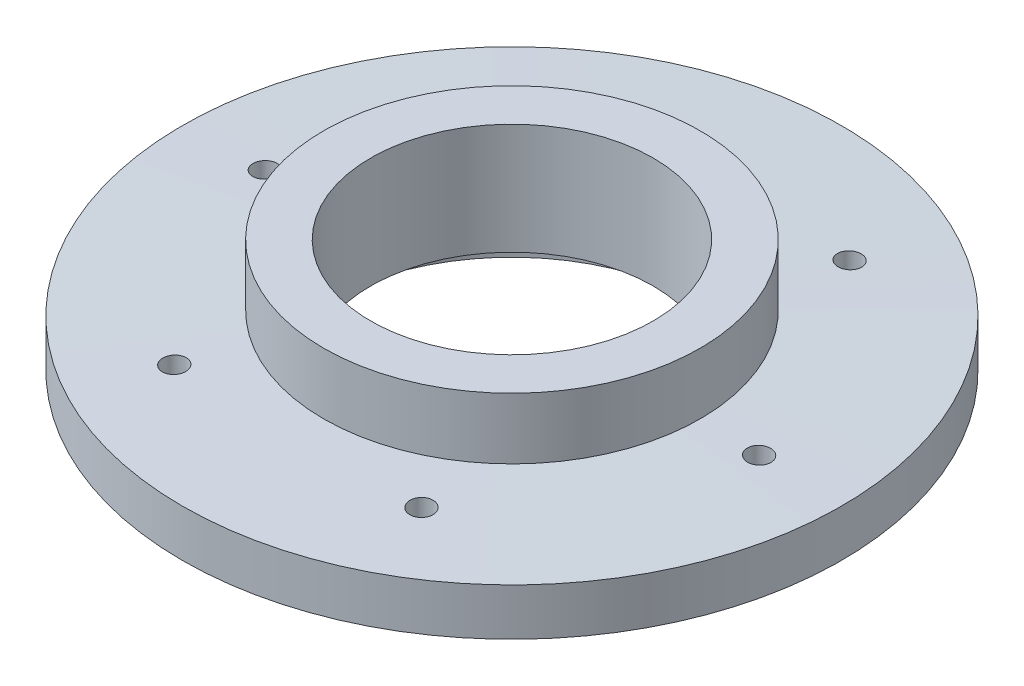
ISO-10303-21;
HEADER;
FILE_DESCRIPTION(('STEP AP214'),'2;1');
FILE_NAME('part.step','',(''),(''),'','','');
FILE_SCHEMA(('AUTOMOTIVE_DESIGN { 1 0 10303 214 1 1 1 1 }'));
ENDSEC;
DATA;
#1=APPLICATION_CONTEXT('core data for automotive mechanical design processes');
#2=APPLICATION_PROTOCOL_DEFINITION('international standard','automotive_design',2000,#1);
#3=PRODUCT_CONTEXT('',#1,'mechanical');
#4=PRODUCT('Part','Part','',(#3));
#5=PRODUCT_RELATED_PRODUCT_CATEGORY('part','',(#4));
#6=PRODUCT_DEFINITION_FORMATION('','',#4);
#7=PRODUCT_DEFINITION_CONTEXT('part definition',#1,'design');
#8=PRODUCT_DEFINITION('design','',#6,#7);
#9=PRODUCT_DEFINITION_SHAPE('','',#8);
#10=(LENGTH_UNIT() NAMED_UNIT(*) SI_UNIT(.MILLI.,.METRE.));
#11=(NAMED_UNIT(*) PLANE_ANGLE_UNIT() SI_UNIT($,.RADIAN.));
#12=(NAMED_UNIT(*) SI_UNIT($,.STERADIAN.) SOLID_ANGLE_UNIT());
#13=UNCERTAINTY_MEASURE_WITH_UNIT(LENGTH_MEASURE(1.E-05),#10,'distance_accuracy_value','');
#14=(GEOMETRIC_REPRESENTATION_CONTEXT(3) GLOBAL_UNCERTAINTY_ASSIGNED_CONTEXT((#13)) GLOBAL_UNIT_ASSIGNED_CONTEXT((#10,
#11,#12)) REPRESENTATION_CONTEXT('',''));
#15=CARTESIAN_POINT('',(0.,0.,0.));
#16=DIRECTION('',(0.,0.,1.));
#17=DIRECTION('',(1.,0.,0.));
#18=AXIS2_PLACEMENT_3D('',#15,#16,#17);
#19=CARTESIAN_POINT('',(0.,-1.0247878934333E-12,0.));
#20=DIRECTION('',(0.,1.,0.));
#21=DIRECTION('',(0.,0.,1.));
#22=AXIS2_PLACEMENT_3D('',#19,#20,#21);
#23=CYLINDRICAL_SURFACE('',#22,8.);
#24=CARTESIAN_POINT('',(0.,1.6,0.));
#25=DIRECTION('',(0.,1.,0.));
#26=DIRECTION('',(0.,0.,1.));
#27=AXIS2_PLACEMENT_3D('',#24,#25,#26);
#28=CIRCLE('',#27,8.);
#29=CARTESIAN_POINT('',(0.,1.6,8.));
#30=VERTEX_POINT('',#29);
#31=EDGE_CURVE('E157',#30,#30,#28,.T.);
#32=ORIENTED_EDGE('',*,*,#31,.T.);
#33=EDGE_LOOP('',(#32));
#34=FACE_BOUND('',#33,.T.);
#35=CARTESIAN_POINT('',(0.,-1.0247878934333E-12,0.));
#36=DIRECTION('',(0.,1.,0.));
#37=DIRECTION('',(0.,0.,1.));
#38=AXIS2_PLACEMENT_3D('',#35,#36,#37);
#39=CIRCLE('',#38,8.);
#40=CARTESIAN_POINT('',(0.,-1.0247878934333E-12,8.));
#41=VERTEX_POINT('',#40);
#42=EDGE_CURVE('E10',#41,#41,#39,.T.);
#43=ORIENTED_EDGE('',*,*,#42,.F.);
#44=EDGE_LOOP('',(#43));
#45=FACE_BOUND('',#44,.T.);
#46=ADVANCED_FACE('F28',(#34,#45),#23,.F.);
#47=CARTESIAN_POINT('',(0.,1.49999999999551,0.));
#48=DIRECTION('',(0.,1.,0.));
#49=DIRECTION('',(0.,0.,1.));
#50=AXIS2_PLACEMENT_3D('',#47,#48,#49);
#51=CONICAL_SURFACE('',#50,14.0000000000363,1.32581766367);
#52=CARTESIAN_POINT('',(-5.60878121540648,0.745457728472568,-9.44151383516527));
#53=CARTESIAN_POINT('',(-5.58975656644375,0.747241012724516,-9.4611122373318));
#54=CARTESIAN_POINT('',(-5.569085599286,0.748510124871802,-9.47918519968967));
#55=CARTESIAN_POINT('',(-5.52502424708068,0.749979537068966,-9.5117322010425));
#56=CARTESIAN_POINT('',(-5.50163103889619,0.750178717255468,-9.52620245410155));
#57=CARTESIAN_POINT('',(-5.45281195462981,0.749500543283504,-9.55110684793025));
#58=CARTESIAN_POINT('',(-5.42738697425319,0.748623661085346,-9.56154275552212));
#59=CARTESIAN_POINT('',(-5.37523224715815,0.745820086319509,-9.5781022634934));
#60=CARTESIAN_POINT('',(-5.34850276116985,0.743893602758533,-9.58422672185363));
#61=CARTESIAN_POINT('',(-5.29443709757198,0.739041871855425,-9.59203813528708));
#62=CARTESIAN_POINT('',(-5.26709978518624,0.736114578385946,-9.59371593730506));
#63=CARTESIAN_POINT('',(-5.21263031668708,0.729344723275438,-9.59261208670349));
#64=CARTESIAN_POINT('',(-5.18549818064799,0.725502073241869,-9.58983000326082));
#65=CARTESIAN_POINT('',(-5.13169501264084,0.71693074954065,-9.57985244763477));
#66=CARTESIAN_POINT('',(-5.10504062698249,0.712187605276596,-9.57257977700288));
#67=CARTESIAN_POINT('',(-5.05340662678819,0.701989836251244,-9.55381631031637));
#68=CARTESIAN_POINT('',(-5.0284272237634,0.69653512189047,-9.54232498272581));
#69=CARTESIAN_POINT('',(-4.98014349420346,0.684902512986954,-9.51512628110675));
#70=CARTESIAN_POINT('',(-4.95690164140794,0.678709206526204,-9.49931460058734));
#71=CARTESIAN_POINT('',(-4.91345512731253,0.665885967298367,-9.46410329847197));
#72=CARTESIAN_POINT('',(-4.89325088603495,0.65925597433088,-9.44470318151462));
#73=CARTESIAN_POINT('',(-4.8559192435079,0.645558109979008,-9.40232632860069));
#74=CARTESIAN_POINT('',(-4.83888370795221,0.63848337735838,-9.37927083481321));
#75=CARTESIAN_POINT('',(-4.80899854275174,0.624247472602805,-9.33061275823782));
#76=CARTESIAN_POINT('',(-4.79614934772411,0.61708629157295,-9.30500991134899));
#77=CARTESIAN_POINT('',(-4.77484651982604,0.602776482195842,-9.2515931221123));
#78=CARTESIAN_POINT('',(-4.76645618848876,0.595629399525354,-9.22375348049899));
#79=CARTESIAN_POINT('',(-4.75461096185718,0.581659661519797,-9.16696245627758));
#80=CARTESIAN_POINT('',(-4.75115611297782,0.574837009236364,-9.13801106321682));
#81=CARTESIAN_POINT('',(-4.74933862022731,0.561762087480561,-9.07997467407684));
#82=CARTESIAN_POINT('',(-4.75094986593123,0.555507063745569,-9.05089113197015));
#83=CARTESIAN_POINT('',(-4.75923285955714,0.543735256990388,-8.99329852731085));
#84=CARTESIAN_POINT('',(-4.76590401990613,0.538218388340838,-8.96478939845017));
#85=CARTESIAN_POINT('',(-4.78396851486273,0.528239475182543,-8.90988149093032));
#86=CARTESIAN_POINT('',(-4.79524636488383,0.523755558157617,-8.88344873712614));
#87=CARTESIAN_POINT('',(-4.8222465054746,0.515844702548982,-8.83278572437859));
#88=CARTESIAN_POINT('',(-4.83796792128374,0.512417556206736,-8.80855503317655));
#89=CARTESIAN_POINT('',(-4.87286140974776,0.506845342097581,-8.76380380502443));
#90=CARTESIAN_POINT('',(-4.89190732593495,0.504662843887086,-8.74318953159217));
#91=CARTESIAN_POINT('',(-4.93323312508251,0.501499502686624,-8.70539775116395));
#92=CARTESIAN_POINT('',(-4.95551247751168,0.500518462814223,-8.68821968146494));
#93=CARTESIAN_POINT('',(-5.00207454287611,0.499805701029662,-8.65820153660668));
#94=CARTESIAN_POINT('',(-5.0262955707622,0.500044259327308,-8.6452663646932));
#95=CARTESIAN_POINT('',(-5.07649127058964,0.501692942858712,-8.62354073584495));
#96=CARTESIAN_POINT('',(-5.10246585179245,0.503103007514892,-8.61475006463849));
#97=CARTESIAN_POINT('',(-5.15530365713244,0.50703252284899,-8.60156467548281));
#98=CARTESIAN_POINT('',(-5.18216253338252,0.509547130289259,-8.5971510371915));
#99=CARTESIAN_POINT('',(-5.23612540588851,0.515593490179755,-8.59272646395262));
#100=CARTESIAN_POINT('',(-5.26322941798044,0.519125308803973,-8.59271581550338));
#101=CARTESIAN_POINT('',(-5.31741377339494,0.527153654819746,-8.5970745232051));
#102=CARTESIAN_POINT('',(-5.34448574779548,0.531665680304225,-8.60151895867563));
#103=CARTESIAN_POINT('',(-5.39741091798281,0.541468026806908,-8.61471250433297));
#104=CARTESIAN_POINT('',(-5.42326394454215,0.546758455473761,-8.62346221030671));
#105=CARTESIAN_POINT('',(-5.47384267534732,0.558122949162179,-8.6452984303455));
#106=CARTESIAN_POINT('',(-5.49851157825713,0.564215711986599,-8.65850676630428));
#107=CARTESIAN_POINT('',(-5.54522807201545,0.576870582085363,-8.68877276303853));
#108=CARTESIAN_POINT('',(-5.56727524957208,0.583432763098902,-8.70583102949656));
#109=CARTESIAN_POINT('',(-5.60878565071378,0.597034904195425,-8.74385627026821));
#110=CARTESIAN_POINT('',(-5.62815577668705,0.604083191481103,-8.76492196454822));
#111=CARTESIAN_POINT('',(-5.66301847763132,0.618279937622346,-8.81002072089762));
#112=CARTESIAN_POINT('',(-5.67851062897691,0.625428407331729,-8.83405410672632));
#113=CARTESIAN_POINT('',(-5.70539787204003,0.639739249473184,-8.88481929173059));
#114=CARTESIAN_POINT('',(-5.71672596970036,0.646900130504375,-8.91158704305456));
#115=CARTESIAN_POINT('',(-5.73459676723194,0.660922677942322,-8.96674998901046));
#116=CARTESIAN_POINT('',(-5.74113959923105,0.667784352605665,-8.9951451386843));
#117=CARTESIAN_POINT('',(-5.74918696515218,0.680988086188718,-9.05263203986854));
#118=CARTESIAN_POINT('',(-5.75071269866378,0.687332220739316,-9.08172033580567));
#119=CARTESIAN_POINT('',(-5.74867273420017,0.699353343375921,-9.13986676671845));
#120=CARTESIAN_POINT('',(-5.74510625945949,0.705030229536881,-9.16892489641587));
#121=CARTESIAN_POINT('',(-5.73303983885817,0.715438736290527,-9.22552816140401));
#122=CARTESIAN_POINT('',(-5.72464268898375,0.720187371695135,-9.25309211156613));
#123=CARTESIAN_POINT('',(-5.70317808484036,0.728736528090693,-9.30646766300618));
#124=CARTESIAN_POINT('',(-5.69011724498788,0.732538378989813,-9.33228168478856));
#125=CARTESIAN_POINT('',(-5.66546839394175,0.737838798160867,-9.37202776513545));
#126=CARTESIAN_POINT('',(-5.65520180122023,0.739663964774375,-9.38675189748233));
#127=CARTESIAN_POINT('',(-5.63312179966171,0.742886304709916,-9.41504242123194));
#128=CARTESIAN_POINT('',(-5.62130841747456,0.744283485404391,-9.42860883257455));
#129=CARTESIAN_POINT('',(-5.60878121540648,0.745457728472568,-9.44151383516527));
#130=B_SPLINE_CURVE_WITH_KNOTS('',3,(#52,#53,#54,#55,#56,#57,#58,#59,#60,#61,#62,#63,#64,#65,
#66,#67,#68,#69,#70,#71,#72,#73,#74,#75,#76,#77,#78,#79,#80,#81,#82,#83,#84,#85,#86,#87,#88,#89,
#90,#91,#92,#93,#94,#95,#96,#97,#98,#99,#100,#101,#102,#103,#104,#105,#106,#107,#108,#109,#110,
#111,#112,#113,#114,#115,#116,#117,#118,#119,#120,#121,#122,#123,#124,#125,#126,#127,#128,#129),
.UNSPECIFIED.,.T.,.F.,(4,2,2,2,2,2,2,2,2,2,2,2,2,2,2,2,2,2,2,2,2,2,2,2,2,2,2,2,2,2,2,2,2,2,2,2,
2,2,4),(0.,0.0820498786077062,0.164185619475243,0.246285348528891,0.328368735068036,
0.41062095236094,0.49288111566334,0.576596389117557,0.660322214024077,0.746281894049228,
0.832253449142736,0.920422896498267,1.00860149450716,1.0980005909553,1.1874005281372,
1.2763404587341,1.36527006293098,1.45209517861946,1.5389032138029,1.62294046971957,
1.70696395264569,1.78894981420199,1.87093143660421,1.95255711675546,2.03418810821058,
2.11721830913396,2.20026000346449,2.28578407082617,2.37132160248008,2.45933133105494,
2.54735066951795,2.63672983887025,2.7261065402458,2.81510509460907,2.90411722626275,
2.99130178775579,3.07836318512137,3.13239167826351,3.18641924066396),.UNSPECIFIED.);
#131=CARTESIAN_POINT('',(-5.60878121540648,0.745457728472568,-9.44151383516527));
#132=VERTEX_POINT('',#131);
#133=EDGE_CURVE('E114',#132,#132,#130,.T.);
#134=ORIENTED_EDGE('',*,*,#133,.F.);
#135=EDGE_LOOP('',(#134));
#136=FACE_BOUND('',#135,.T.);
#137=CARTESIAN_POINT('',(4.89071067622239,0.505040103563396,8.74554323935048));
#138=CARTESIAN_POINT('',(4.90960334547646,0.503086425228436,8.72602373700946));
#139=CARTESIAN_POINT('',(4.93013140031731,0.501685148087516,8.70800665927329));
#140=CARTESIAN_POINT('',(4.97389219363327,0.500044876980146,8.67552487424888));
#141=CARTESIAN_POINT('',(4.99712760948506,0.499807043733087,8.66106372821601));
#142=CARTESIAN_POINT('',(5.04562213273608,0.500504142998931,8.63613168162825));
#143=CARTESIAN_POINT('',(5.07088038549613,0.501438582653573,8.62565910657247));
#144=CARTESIAN_POINT('',(5.12269607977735,0.504443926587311,8.60897909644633));
#145=CARTESIAN_POINT('',(5.14925328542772,0.506514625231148,8.60277089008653));
#146=CARTESIAN_POINT('',(5.20298607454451,0.511722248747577,8.59473943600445));
#147=CARTESIAN_POINT('',(5.23016303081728,0.514861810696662,8.59292712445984));
#148=CARTESIAN_POINT('',(5.28432437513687,0.522095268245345,8.59371130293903));
#149=CARTESIAN_POINT('',(5.31130874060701,0.526189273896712,8.59630830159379));
#150=CARTESIAN_POINT('',(5.36496180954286,0.535296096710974,8.60588324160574));
#151=CARTESIAN_POINT('',(5.39161027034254,0.540327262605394,8.61295697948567));
#152=CARTESIAN_POINT('',(5.4432653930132,0.551083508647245,8.6313141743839));
#153=CARTESIAN_POINT('',(5.46827180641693,0.556808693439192,8.64259826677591));
#154=CARTESIAN_POINT('',(5.51675910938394,0.568968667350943,8.66943780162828));
#155=CARTESIAN_POINT('',(5.54016839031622,0.575419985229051,8.6851151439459));
#156=CARTESIAN_POINT('',(5.58397171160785,0.588688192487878,8.72010589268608));
#157=CARTESIAN_POINT('',(5.60436531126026,0.595505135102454,8.73941982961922));
#158=CARTESIAN_POINT('',(5.6421017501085,0.609494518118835,8.78169089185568));
#159=CARTESIAN_POINT('',(5.65935143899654,0.616671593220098,8.80472971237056));
#160=CARTESIAN_POINT('',(5.68965687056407,0.631008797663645,8.85342427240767));
#161=CARTESIAN_POINT('',(5.70271225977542,0.63816892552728,8.87908023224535));
#162=CARTESIAN_POINT('',(5.72435799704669,0.652345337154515,8.93256550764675));
#163=CARTESIAN_POINT('',(5.73290287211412,0.659359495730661,8.96041382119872));
#164=CARTESIAN_POINT('',(5.74504461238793,0.672973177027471,9.01726871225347));
#165=CARTESIAN_POINT('',(5.74864159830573,0.679572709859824,9.04627526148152));
#166=CARTESIAN_POINT('',(5.75071238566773,0.69210753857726,9.1043180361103));
#167=CARTESIAN_POINT('',(5.74923598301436,0.698048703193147,9.13335119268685));
#168=CARTESIAN_POINT('',(5.74124029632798,0.709168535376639,9.19086576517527));
#169=CARTESIAN_POINT('',(5.7347216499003,0.714347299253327,9.21934725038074));
#170=CARTESIAN_POINT('',(5.71698358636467,0.723671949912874,9.27420030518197));
#171=CARTESIAN_POINT('',(5.70588250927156,0.727839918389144,9.30060636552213));
#172=CARTESIAN_POINT('',(5.67926289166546,0.735177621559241,9.35124165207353));
#173=CARTESIAN_POINT('',(5.66374509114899,0.738347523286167,9.37547124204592));
#174=CARTESIAN_POINT('',(5.62920437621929,0.743518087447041,9.42035015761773));
#175=CARTESIAN_POINT('',(5.61029093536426,0.745548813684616,9.44108030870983));
#176=CARTESIAN_POINT('',(5.56921791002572,0.748512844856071,9.47912048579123));
#177=CARTESIAN_POINT('',(5.54705874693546,0.749446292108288,9.49643095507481));
#178=CARTESIAN_POINT('',(5.50060035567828,0.750180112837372,9.52680426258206));
#179=CARTESIAN_POINT('',(5.47635121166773,0.750002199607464,9.53994326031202));
#180=CARTESIAN_POINT('',(5.42605261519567,0.748569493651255,9.56205248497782));
#181=CARTESIAN_POINT('',(5.40000324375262,0.747314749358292,9.57102289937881));
#182=CARTESIAN_POINT('',(5.34695193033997,0.743772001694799,9.58453748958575));
#183=CARTESIAN_POINT('',(5.31995380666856,0.741487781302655,9.58909768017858));
#184=CARTESIAN_POINT('',(5.26567489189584,0.735952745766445,9.59376291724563));
#185=CARTESIAN_POINT('',(5.23839408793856,0.732701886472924,9.59386776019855));
#186=CARTESIAN_POINT('',(5.18394027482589,0.725275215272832,9.58964524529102));
#187=CARTESIAN_POINT('',(5.15677337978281,0.72108782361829,9.58525969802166));
#188=CARTESIAN_POINT('',(5.1036469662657,0.711928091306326,9.57215049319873));
#189=CARTESIAN_POINT('',(5.07768758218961,0.706955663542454,9.56342635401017));
#190=CARTESIAN_POINT('',(5.02702654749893,0.696225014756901,9.54166552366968));
#191=CARTESIAN_POINT('',(5.00237196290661,0.690450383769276,9.52852738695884));
#192=CARTESIAN_POINT('',(4.95567535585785,0.678367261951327,9.49841509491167));
#193=CARTESIAN_POINT('',(4.93363370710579,0.672058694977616,9.4814403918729));
#194=CARTESIAN_POINT('',(4.89216240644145,0.658893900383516,9.4436387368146));
#195=CARTESIAN_POINT('',(4.87281983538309,0.652027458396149,9.4227197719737));
#196=CARTESIAN_POINT('',(4.83798169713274,0.638086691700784,9.37795194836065));
#197=CARTESIAN_POINT('',(4.82248659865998,0.631012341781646,9.35410273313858));
#198=CARTESIAN_POINT('',(4.79550361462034,0.616712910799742,9.30366212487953));
#199=CARTESIAN_POINT('',(4.78409610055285,0.609487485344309,9.27702778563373));
#200=CARTESIAN_POINT('',(4.76603214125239,0.595224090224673,9.22214549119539));
#201=CARTESIAN_POINT('',(4.75937573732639,0.588186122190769,9.19389752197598));
#202=CARTESIAN_POINT('',(4.75103304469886,0.574498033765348,9.13654295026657));
#203=CARTESIAN_POINT('',(4.74935323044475,0.567848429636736,9.10743527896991));
#204=CARTESIAN_POINT('',(4.75109295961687,0.555156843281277,9.04922880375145));
#205=CARTESIAN_POINT('',(4.75451340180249,0.549114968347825,9.02013000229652));
#206=CARTESIAN_POINT('',(4.76632124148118,0.53794843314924,8.96333831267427));
#207=CARTESIAN_POINT('',(4.77461894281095,0.532809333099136,8.93562960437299));
#208=CARTESIAN_POINT('',(4.79593585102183,0.523507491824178,8.88194369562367));
#209=CARTESIAN_POINT('',(4.80894827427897,0.519343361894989,8.8559640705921));
#210=CARTESIAN_POINT('',(4.83361399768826,0.513502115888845,8.81586706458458));
#211=CARTESIAN_POINT('',(4.84393572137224,0.511478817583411,8.80096507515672));
#212=CARTESIAN_POINT('',(4.86616457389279,0.507901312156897,8.77233235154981));
#213=CARTESIAN_POINT('',(4.87807166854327,0.506347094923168,8.75860159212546));
#214=CARTESIAN_POINT('',(4.89071067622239,0.505040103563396,8.74554323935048));
#215=B_SPLINE_CURVE_WITH_KNOTS('',3,(#137,#138,#139,#140,#141,#142,#143,#144,#145,#146,#147,
#148,#149,#150,#151,#152,#153,#154,#155,#156,#157,#158,#159,#160,#161,#162,#163,#164,#165,#166,
#167,#168,#169,#170,#171,#172,#173,#174,#175,#176,#177,#178,#179,#180,#181,#182,#183,#184,#185,
#186,#187,#188,#189,#190,#191,#192,#193,#194,#195,#196,#197,#198,#199,#200,#201,#202,#203,#204,
#205,#206,#207,#208,#209,#210,#211,#212,#213,#214),.UNSPECIFIED.,.T.,.F.,(4,2,2,2,2,2,2,2,2,2,2,
2,2,2,2,2,2,2,2,2,2,2,2,2,2,2,2,2,2,2,2,2,2,2,2,2,2,2,4),(0.,0.081639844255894,
0.163361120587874,0.245048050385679,0.326720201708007,0.408595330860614,0.49047990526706,
0.574178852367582,0.657890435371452,0.744204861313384,0.830531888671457,0.919104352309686,
1.00768427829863,1.09714094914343,1.18659543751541,1.27517443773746,1.36374223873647,
1.45015321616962,1.53654972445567,1.6205436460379,1.70452667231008,1.78687407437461,
1.86921777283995,1.95126132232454,2.03330861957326,2.11643276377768,2.19956613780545,
2.28475821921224,2.36996247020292,2.45747817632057,2.54500453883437,2.63416799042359,
2.7233322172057,2.81261239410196,2.90190830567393,2.98961122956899,3.0771884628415,
3.13180588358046,3.18642212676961),.UNSPECIFIED.);
#216=CARTESIAN_POINT('',(4.89071067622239,0.505040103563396,8.74554323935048));
#217=VERTEX_POINT('',#216);
#218=EDGE_CURVE('E107',#217,#217,#215,.T.);
#219=ORIENTED_EDGE('',*,*,#218,.F.);
#220=EDGE_LOOP('',(#219));
#221=FACE_BOUND('',#220,.T.);
#222=CARTESIAN_POINT('',(10.1574892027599,0.54100466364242,-0.364261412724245));
#223=CARTESIAN_POINT('',(10.1784479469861,0.546417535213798,-0.383966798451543));
#224=CARTESIAN_POINT('',(10.2010736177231,0.552243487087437,-0.401823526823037));
#225=CARTESIAN_POINT('',(10.2489510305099,0.564524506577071,-0.433357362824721));
#226=CARTESIAN_POINT('',(10.2742069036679,0.570980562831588,-0.447027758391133));
#227=CARTESIAN_POINT('',(10.3265471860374,0.584305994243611,-0.469816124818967));
#228=CARTESIAN_POINT('',(10.3536288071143,0.591174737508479,-0.478940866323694));
#229=CARTESIAN_POINT('',(10.408883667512,0.605131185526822,-0.492449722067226));
#230=CARTESIAN_POINT('',(10.4370565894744,0.612218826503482,-0.496835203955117));
#231=CARTESIAN_POINT('',(10.4941802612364,0.626530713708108,-0.50079790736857));
#232=CARTESIAN_POINT('',(10.5231362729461,0.6337553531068,-0.500298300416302));
#233=CARTESIAN_POINT('',(10.580575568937,0.648028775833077,-0.49430908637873));
#234=CARTESIAN_POINT('',(10.6090588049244,0.655077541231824,-0.488818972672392));
#235=CARTESIAN_POINT('',(10.6647900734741,0.668817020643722,-0.47295376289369));
#236=CARTESIAN_POINT('',(10.6920354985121,0.67550698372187,-0.462568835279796));
#237=CARTESIAN_POINT('',(10.7444156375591,0.688324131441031,-0.437159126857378));
#238=CARTESIAN_POINT('',(10.7695505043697,0.694451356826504,-0.422134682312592));
#239=CARTESIAN_POINT('',(10.8165300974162,0.705869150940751,-0.388118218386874));
#240=CARTESIAN_POINT('',(10.8384225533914,0.71117192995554,-0.369196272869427));
#241=CARTESIAN_POINT('',(10.8787068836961,0.720905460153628,-0.327743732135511));
#242=CARTESIAN_POINT('',(10.8970992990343,0.725336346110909,-0.305213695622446));
#243=CARTESIAN_POINT('',(10.929320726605,0.733083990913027,-0.257840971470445));
#244=CARTESIAN_POINT('',(10.9432603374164,0.736427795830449,-0.233077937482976));
#245=CARTESIAN_POINT('',(10.9667765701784,0.742061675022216,-0.18144929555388));
#246=CARTESIAN_POINT('',(10.9763538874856,0.744351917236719,-0.154584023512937));
#247=CARTESIAN_POINT('',(10.9906285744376,0.747763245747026,-0.100259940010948));
#248=CARTESIAN_POINT('',(10.9954452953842,0.748912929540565,-0.0728342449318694));
#249=CARTESIAN_POINT('',(11.0004624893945,0.750110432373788,-0.0175409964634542));
#250=CARTESIAN_POINT('',(11.0006634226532,0.750158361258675,0.0103265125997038));
#251=CARTESIAN_POINT('',(10.9964723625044,0.749158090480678,0.0653065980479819));
#252=CARTESIAN_POINT('',(10.9921434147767,0.748124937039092,0.0924242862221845));
#253=CARTESIAN_POINT('',(10.9791327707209,0.745016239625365,0.14553069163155));
#254=CARTESIAN_POINT('',(10.9704511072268,0.742940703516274,0.171519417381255));
#255=CARTESIAN_POINT('',(10.9489789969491,0.73779866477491,0.22173405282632));
#256=CARTESIAN_POINT('',(10.9361751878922,0.734728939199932,0.245953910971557));
#257=CARTESIAN_POINT('',(10.906867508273,0.72768692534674,0.29189273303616));
#258=CARTESIAN_POINT('',(10.8903633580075,0.723714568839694,0.313611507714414));
#259=CARTESIAN_POINT('',(10.8538098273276,0.714893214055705,0.354375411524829));
#260=CARTESIAN_POINT('',(10.8337000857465,0.710029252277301,0.373363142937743));
#261=CARTESIAN_POINT('',(10.7907455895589,0.699607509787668,0.407705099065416));
#262=CARTESIAN_POINT('',(10.7679004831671,0.694049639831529,0.423058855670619));
#263=CARTESIAN_POINT('',(10.7194696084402,0.682226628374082,0.450136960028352));
#264=CARTESIAN_POINT('',(10.6938265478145,0.675946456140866,0.461752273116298));
#265=CARTESIAN_POINT('',(10.6410522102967,0.662972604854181,0.480508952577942));
#266=CARTESIAN_POINT('',(10.6139207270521,0.656278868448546,0.487649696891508));
#267=CARTESIAN_POINT('',(10.5582145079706,0.642480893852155,0.497423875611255));
#268=CARTESIAN_POINT('',(10.5296206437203,0.635370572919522,0.499939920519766));
#269=CARTESIAN_POINT('',(10.4724359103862,0.621091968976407,0.500057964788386));
#270=CARTESIAN_POINT('',(10.443845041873,0.613923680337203,0.497659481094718));
#271=CARTESIAN_POINT('',(10.3870998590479,0.599638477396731,0.48794718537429));
#272=CARTESIAN_POINT('',(10.3589556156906,0.59252335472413,0.480571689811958));
#273=CARTESIAN_POINT('',(10.3042907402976,0.578648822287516,0.461021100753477));
#274=CARTESIAN_POINT('',(10.2777701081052,0.571889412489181,0.448846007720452));
#275=CARTESIAN_POINT('',(10.2273112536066,0.558981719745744,0.420093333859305));
#276=CARTESIAN_POINT('',(10.2033570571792,0.552829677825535,0.403545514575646));
#277=CARTESIAN_POINT('',(10.1585754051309,0.541291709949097,0.366434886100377));
#278=CARTESIAN_POINT('',(10.1377475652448,0.53590568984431,0.34587257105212));
#279=CARTESIAN_POINT('',(10.1003739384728,0.526215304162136,0.301847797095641));
#280=CARTESIAN_POINT('',(10.0837349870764,0.521887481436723,0.27846964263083));
#281=CARTESIAN_POINT('',(10.0546433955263,0.514305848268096,0.229081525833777));
#282=CARTESIAN_POINT('',(10.0421899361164,0.511051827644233,0.203072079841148));
#283=CARTESIAN_POINT('',(10.0222336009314,0.505830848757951,0.150053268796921));
#284=CARTESIAN_POINT('',(10.0145855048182,0.503826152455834,0.123102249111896));
#285=CARTESIAN_POINT('',(10.0038917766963,0.501021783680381,0.0682433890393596));
#286=CARTESIAN_POINT('',(10.0008452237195,0.500221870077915,0.0403357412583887));
#287=CARTESIAN_POINT('',(9.99947678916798,0.49986265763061,-0.0149520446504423));
#288=CARTESIAN_POINT('',(10.0010468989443,0.500274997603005,-0.0423293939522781));
#289=CARTESIAN_POINT('',(10.0086263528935,0.502263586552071,-0.0964255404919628));
#290=CARTESIAN_POINT('',(10.0146366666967,0.503840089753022,-0.123144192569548));
#291=CARTESIAN_POINT('',(10.0308751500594,0.508092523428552,-0.175104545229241));
#292=CARTESIAN_POINT('',(10.0410940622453,0.510766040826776,-0.200349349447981));
#293=CARTESIAN_POINT('',(10.0654133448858,0.517114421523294,-0.248728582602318));
#294=CARTESIAN_POINT('',(10.0795091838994,0.520788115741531,-0.2718654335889));
#295=CARTESIAN_POINT('',(10.1045685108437,0.527301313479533,-0.30640303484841));
#296=CARTESIAN_POINT('',(10.1144070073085,0.529855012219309,-0.318691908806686));
#297=CARTESIAN_POINT('',(10.1351620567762,0.535233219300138,-0.342256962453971));
#298=CARTESIAN_POINT('',(10.1460785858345,0.538057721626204,-0.353533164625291));
#299=CARTESIAN_POINT('',(10.1574892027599,0.54100466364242,-0.364261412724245));
#300=B_SPLINE_CURVE_WITH_KNOTS('',3,(#222,#223,#224,#225,#226,#227,#228,#229,#230,#231,#232,
#233,#234,#235,#236,#237,#238,#239,#240,#241,#242,#243,#244,#245,#246,#247,#248,#249,#250,#251,
#252,#253,#254,#255,#256,#257,#258,#259,#260,#261,#262,#263,#264,#265,#266,#267,#268,#269,#270,
#271,#272,#273,#274,#275,#276,#277,#278,#279,#280,#281,#282,#283,#284,#285,#286,#287,#288,#289,
#290,#291,#292,#293,#294,#295,#296,#297,#298,#299),.UNSPECIFIED.,.T.,.F.,(4,2,2,2,2,2,2,2,2,2,2,
2,2,2,2,2,2,2,2,2,2,2,2,2,2,2,2,2,2,2,2,2,2,2,2,2,2,2,4),(0.,0.087757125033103,
0.175654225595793,0.263420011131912,0.351160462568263,0.440283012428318,0.529414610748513,
0.618726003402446,0.708030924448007,0.795851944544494,0.883659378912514,0.969076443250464,
1.0544798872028,1.13768335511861,1.22087852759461,1.30293101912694,1.38498289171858,
1.46730346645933,1.54963026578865,1.63349198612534,1.71736450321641,1.80349871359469,
1.88964489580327,1.97794904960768,2.06626188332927,2.15568984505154,2.24511779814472,
2.33395210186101,2.42277547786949,2.5094020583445,2.59601167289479,2.67985907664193,
2.76368969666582,2.84557478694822,2.92747776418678,3.00920153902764,3.09083019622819,
3.13860906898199,3.18638688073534),.UNSPECIFIED.);
#301=CARTESIAN_POINT('',(10.1574892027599,0.54100466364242,-0.364261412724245));
#302=VERTEX_POINT('',#301);
#303=EDGE_CURVE('E102',#302,#302,#300,.T.);
#304=ORIENTED_EDGE('',*,*,#303,.F.);
#305=EDGE_LOOP('',(#304));
#306=FACE_BOUND('',#305,.T.);
#307=CARTESIAN_POINT('',(4.89091013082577,0.658208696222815,-9.44119556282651));
#308=CARTESIAN_POINT('',(4.91062719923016,0.664992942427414,-9.4615435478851));
#309=CARTESIAN_POINT('',(4.93211720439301,0.671619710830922,-9.48025368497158));
#310=CARTESIAN_POINT('',(4.97807730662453,0.684375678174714,-9.51382514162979));
#311=CARTESIAN_POINT('',(5.00255047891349,0.690504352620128,-9.52868243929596));
#312=CARTESIAN_POINT('',(5.0538212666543,0.702093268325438,-9.55406193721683));
#313=CARTESIAN_POINT('',(5.08062029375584,0.707553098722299,-9.56458148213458));
#314=CARTESIAN_POINT('',(5.13576495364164,0.717640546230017,-9.58089030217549));
#315=CARTESIAN_POINT('',(5.16411011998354,0.722268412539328,-9.58668099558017));
#316=CARTESIAN_POINT('',(5.22093998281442,0.73047183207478,-9.59322394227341));
#317=CARTESIAN_POINT('',(5.24941053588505,0.734066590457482,-9.59407470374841));
#318=CARTESIAN_POINT('',(5.30619457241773,0.740217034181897,-9.5909116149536));
#319=CARTESIAN_POINT('',(5.33450807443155,0.742772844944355,-9.58689835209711));
#320=CARTESIAN_POINT('',(5.38937378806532,0.746713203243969,-9.57425170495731));
#321=CARTESIAN_POINT('',(5.41595278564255,0.748126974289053,-9.56574347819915));
#322=CARTESIAN_POINT('',(5.46735541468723,0.749852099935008,-9.54441049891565));
#323=CARTESIAN_POINT('',(5.49217924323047,0.750163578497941,-9.531586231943));
#324=CARTESIAN_POINT('',(5.53897159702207,0.74967871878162,-9.50222463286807));
#325=CARTESIAN_POINT('',(5.56097852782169,0.748899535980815,-9.48574815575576));
#326=CARTESIAN_POINT('',(5.60196512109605,0.746287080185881,-9.44945462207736));
#327=CARTESIAN_POINT('',(5.62094484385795,0.744453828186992,-9.42963763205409));
#328=CARTESIAN_POINT('',(5.65538807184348,0.739783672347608,-9.3872189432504));
#329=CARTESIAN_POINT('',(5.67084728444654,0.736945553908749,-9.36461389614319));
#330=CARTESIAN_POINT('',(5.69783343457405,0.730346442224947,-9.31729197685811));
#331=CARTESIAN_POINT('',(5.70936010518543,0.726585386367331,-9.29257496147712));
#332=CARTESIAN_POINT('',(5.72838328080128,0.718171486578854,-9.24128769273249));
#333=CARTESIAN_POINT('',(5.73580751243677,0.713504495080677,-9.21469297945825));
#334=CARTESIAN_POINT('',(5.74618146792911,0.703448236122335,-9.16077869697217));
#335=CARTESIAN_POINT('',(5.74913063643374,0.698058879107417,-9.13345903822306));
#336=CARTESIAN_POINT('',(5.75055637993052,0.686547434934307,-9.07810215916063));
#337=CARTESIAN_POINT('',(5.74891248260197,0.680409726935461,-9.05006508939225));
#338=CARTESIAN_POINT('',(5.74099562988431,0.667683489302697,-8.9947576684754));
#339=CARTESIAN_POINT('',(5.73472202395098,0.661094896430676,-8.96748742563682));
#340=CARTESIAN_POINT('',(5.71753408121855,0.647463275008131,-8.91374485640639));
#341=CARTESIAN_POINT('',(5.70650395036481,0.640412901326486,-8.88731139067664));
#342=CARTESIAN_POINT('',(5.68011863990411,0.626208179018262,-8.8367284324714));
#343=CARTESIAN_POINT('',(5.66476300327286,0.619053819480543,-8.81257918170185));
#344=CARTESIAN_POINT('',(5.62989560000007,0.604733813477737,-8.76689756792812));
#345=CARTESIAN_POINT('',(5.61032651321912,0.597569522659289,-8.74540848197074));
#346=CARTESIAN_POINT('',(5.56770595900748,0.583545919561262,-8.70609304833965));
#347=CARTESIAN_POINT('',(5.54465443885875,0.576686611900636,-8.68826675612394));
#348=CARTESIAN_POINT('',(5.49580425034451,0.563512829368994,-8.65689616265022));
#349=CARTESIAN_POINT('',(5.47001757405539,0.557196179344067,-8.64333412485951));
#350=CARTESIAN_POINT('',(5.41633830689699,0.545283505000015,-8.62084956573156));
#351=CARTESIAN_POINT('',(5.38844594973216,0.539687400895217,-8.61192653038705));
#352=CARTESIAN_POINT('',(5.33202610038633,0.529532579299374,-8.59921342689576));
#353=CARTESIAN_POINT('',(5.30352791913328,0.524952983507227,-8.59531014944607));
#354=CARTESIAN_POINT('',(5.24613643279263,0.516839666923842,-8.59245736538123));
#355=CARTESIAN_POINT('',(5.21724320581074,0.513305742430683,-8.59350689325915));
#356=CARTESIAN_POINT('',(5.16086625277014,0.507516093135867,-8.60048261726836));
#357=CARTESIAN_POINT('',(5.1333669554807,0.505223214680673,-8.60625229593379));
#358=CARTESIAN_POINT('',(5.07965706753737,0.501836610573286,-8.62234340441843));
#359=CARTESIAN_POINT('',(5.05344626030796,0.500742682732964,-8.63266406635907));
#360=CARTESIAN_POINT('',(5.00373966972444,0.499809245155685,-8.65725568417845));
#361=CARTESIAN_POINT('',(4.9801924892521,0.499939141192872,-8.67142173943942));
#362=CARTESIAN_POINT('',(4.93575737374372,0.501374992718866,-8.70339415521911));
#363=CARTESIAN_POINT('',(4.91486928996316,0.502680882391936,-8.72120031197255));
#364=CARTESIAN_POINT('',(4.87643526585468,0.506408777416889,-8.75981861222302));
#365=CARTESIAN_POINT('',(4.85887195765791,0.508824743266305,-8.78061407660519));
#366=CARTESIAN_POINT('',(4.82739846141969,0.514682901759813,-8.82467576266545));
#367=CARTESIAN_POINT('',(4.81348850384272,0.518125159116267,-8.8479421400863));
#368=CARTESIAN_POINT('',(4.78945165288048,0.525981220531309,-8.89668203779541));
#369=CARTESIAN_POINT('',(4.77939014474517,0.53040995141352,-8.92218536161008));
#370=CARTESIAN_POINT('',(4.76358240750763,0.540058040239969,-8.97435076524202));
#371=CARTESIAN_POINT('',(4.7578366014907,0.545277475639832,-9.00101295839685));
#372=CARTESIAN_POINT('',(4.75064121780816,0.556509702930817,-9.05558053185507));
#373=CARTESIAN_POINT('',(4.7493233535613,0.562541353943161,-9.08349938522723));
#374=CARTESIAN_POINT('',(4.75132605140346,0.575091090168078,-9.13906725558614));
#375=CARTESIAN_POINT('',(4.75464843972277,0.581609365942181,-9.16671616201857));
#376=CARTESIAN_POINT('',(4.76596631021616,0.595143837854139,-9.22182033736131));
#377=CARTESIAN_POINT('',(4.77409773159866,0.602169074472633,-9.24924543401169));
#378=CARTESIAN_POINT('',(4.79488629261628,0.616331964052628,-9.3022664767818));
#379=CARTESIAN_POINT('',(4.80753876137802,0.623469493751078,-9.32786427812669));
#380=CARTESIAN_POINT('',(4.83198139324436,0.635242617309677,-9.36824500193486));
#381=CARTESIAN_POINT('',(4.84259886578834,0.639902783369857,-9.38374310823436));
#382=CARTESIAN_POINT('',(4.86552063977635,0.649134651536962,-9.41346645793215));
#383=CARTESIAN_POINT('',(4.87782496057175,0.653706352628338,-9.42769168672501));
#384=CARTESIAN_POINT('',(4.89091013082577,0.658208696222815,-9.44119556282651));
#385=B_SPLINE_CURVE_WITH_KNOTS('',3,(#307,#308,#309,#310,#311,#312,#313,#314,#315,#316,#317,
#318,#319,#320,#321,#322,#323,#324,#325,#326,#327,#328,#329,#330,#331,#332,#333,#334,#335,#336,
#337,#338,#339,#340,#341,#342,#343,#344,#345,#346,#347,#348,#349,#350,#351,#352,#353,#354,#355,
#356,#357,#358,#359,#360,#361,#362,#363,#364,#365,#366,#367,#368,#369,#370,#371,#372,#373,#374,
#375,#376,#377,#378,#379,#380,#381,#382,#383,#384),.UNSPECIFIED.,.T.,.F.,(4,2,2,2,2,2,2,2,2,2,2,
2,2,2,2,2,2,2,2,2,2,2,2,2,2,2,2,2,2,2,2,2,2,2,2,2,2,2,4),(0.,0.087335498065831,
0.174761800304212,0.262241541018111,0.349695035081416,0.435398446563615,0.521091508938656,
0.604515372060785,0.687929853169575,0.770046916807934,0.852162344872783,0.934377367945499,
1.01659797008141,1.1002243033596,1.18386101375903,1.26971188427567,1.35557482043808,
1.44365777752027,1.53175004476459,1.6211264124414,1.71050413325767,1.79950502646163,
1.88849605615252,1.97544271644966,2.062372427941,2.14653112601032,2.23067562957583,
2.3127223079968,2.39476439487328,2.47636531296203,2.5579713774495,2.64090811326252,
2.72385297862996,2.80924425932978,2.89466915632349,2.98263267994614,3.07050558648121,
3.12846484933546,3.18642477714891),.UNSPECIFIED.);
#386=CARTESIAN_POINT('',(4.89091013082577,0.658208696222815,-9.44119556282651));
#387=VERTEX_POINT('',#386);
#388=EDGE_CURVE('E98',#387,#387,#385,.T.);
#389=ORIENTED_EDGE('',*,*,#388,.F.);
#390=EDGE_LOOP('',(#389));
#391=FACE_BOUND('',#390,.T.);
#392=CARTESIAN_POINT('',(-10.8428765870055,0.712245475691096,-0.363917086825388));
#393=CARTESIAN_POINT('',(-10.8220008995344,0.70719441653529,-0.383583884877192));
#394=CARTESIAN_POINT('',(-10.7994637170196,0.701727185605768,-0.40141726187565));
#395=CARTESIAN_POINT('',(-10.7517750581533,0.690118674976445,-0.432930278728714));
#396=CARTESIAN_POINT('',(-10.7266195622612,0.683976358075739,-0.446603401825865));
#397=CARTESIAN_POINT('',(-10.6744966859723,0.67120152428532,-0.469423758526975));
#398=CARTESIAN_POINT('',(-10.6475321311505,0.66456977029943,-0.478577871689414));
#399=CARTESIAN_POINT('',(-10.5925296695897,0.650988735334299,-0.492179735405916));
#400=CARTESIAN_POINT('',(-10.5644920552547,0.64403954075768,-0.49662875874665));
#401=CARTESIAN_POINT('',(-10.5076174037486,0.62988569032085,-0.500768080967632));
#402=CARTESIAN_POINT('',(-10.4787748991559,0.622678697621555,-0.500375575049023));
#403=CARTESIAN_POINT('',(-10.4215664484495,0.608324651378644,-0.494646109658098));
#404=CARTESIAN_POINT('',(-10.3932005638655,0.601177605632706,-0.489308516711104));
#405=CARTESIAN_POINT('',(-10.3375399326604,0.587097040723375,-0.473759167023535));
#406=CARTESIAN_POINT('',(-10.3102546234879,0.580165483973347,-0.463511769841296));
#407=CARTESIAN_POINT('',(-10.2577799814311,0.566784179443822,-0.438378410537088));
#408=CARTESIAN_POINT('',(-10.2325905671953,0.560334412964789,-0.423492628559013));
#409=CARTESIAN_POINT('',(-10.1853801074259,0.548204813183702,-0.38967525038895));
#410=CARTESIAN_POINT('',(-10.1633232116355,0.542516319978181,-0.370796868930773));
#411=CARTESIAN_POINT('',(-10.122710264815,0.532012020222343,-0.329382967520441));
#412=CARTESIAN_POINT('',(-10.1041536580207,0.527196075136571,-0.306848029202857));
#413=CARTESIAN_POINT('',(-10.0716380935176,0.518738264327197,-0.259439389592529));
#414=CARTESIAN_POINT('',(-10.0575636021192,0.515066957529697,-0.234650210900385));
#415=CARTESIAN_POINT('',(-10.0337932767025,0.508856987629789,-0.182923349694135));
#416=CARTESIAN_POINT('',(-10.0240965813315,0.506318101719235,-0.155986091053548));
#417=CARTESIAN_POINT('',(-10.0096548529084,0.502533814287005,-0.101626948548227));
#418=CARTESIAN_POINT('',(-10.0047658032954,0.501250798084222,-0.0742458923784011));
#419=CARTESIAN_POINT('',(-9.99959331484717,0.499893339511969,-0.0190237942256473));
#420=CARTESIAN_POINT('',(-9.99930928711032,0.499818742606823,0.00881718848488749));
#421=CARTESIAN_POINT('',(-10.0033192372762,0.500871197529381,0.063642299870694));
#422=CARTESIAN_POINT('',(-10.0075316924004,0.501976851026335,0.0906328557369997));
#423=CARTESIAN_POINT('',(-10.0202645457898,0.505314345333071,0.143503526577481));
#424=CARTESIAN_POINT('',(-10.0287849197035,0.507546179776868,0.169383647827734));
#425=CARTESIAN_POINT('',(-10.0498973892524,0.513065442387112,0.219427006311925));
#426=CARTESIAN_POINT('',(-10.0625058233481,0.516357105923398,0.243582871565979));
#427=CARTESIAN_POINT('',(-10.0913871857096,0.523877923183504,0.289430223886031));
#428=CARTESIAN_POINT('',(-10.1076604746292,0.528107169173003,0.311121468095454));
#429=CARTESIAN_POINT('',(-10.1438045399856,0.537472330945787,0.351974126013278));
#430=CARTESIAN_POINT('',(-10.1637502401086,0.542627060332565,0.371064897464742));
#431=CARTESIAN_POINT('',(-10.2063891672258,0.55360840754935,0.405643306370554));
#432=CARTESIAN_POINT('',(-10.2290828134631,0.559435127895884,0.421130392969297));
#433=CARTESIAN_POINT('',(-10.2773341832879,0.571777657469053,0.448568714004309));
#434=CARTESIAN_POINT('',(-10.302959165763,0.578309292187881,0.460394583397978));
#435=CARTESIAN_POINT('',(-10.3557510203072,0.59171142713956,0.479563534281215));
#436=CARTESIAN_POINT('',(-10.3829181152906,0.598581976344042,0.486905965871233));
#437=CARTESIAN_POINT('',(-10.4387561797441,0.612645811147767,0.497065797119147));
#438=CARTESIAN_POINT('',(-10.4674477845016,0.61984286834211,0.499764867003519));
#439=CARTESIAN_POINT('',(-10.5248822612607,0.634190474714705,0.500205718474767));
#440=CARTESIAN_POINT('',(-10.5536251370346,0.641341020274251,0.497947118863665));
#441=CARTESIAN_POINT('',(-10.6105971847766,0.655458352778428,0.488476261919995));
#442=CARTESIAN_POINT('',(-10.6388199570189,0.662423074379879,0.481222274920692));
#443=CARTESIAN_POINT('',(-10.6936735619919,0.675909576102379,0.461883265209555));
#444=CARTESIAN_POINT('',(-10.7203044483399,0.682431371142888,0.449798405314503));
#445=CARTESIAN_POINT('',(-10.7708817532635,0.694776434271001,0.421256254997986));
#446=CARTESIAN_POINT('',(-10.7948547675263,0.700606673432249,0.404849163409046));
#447=CARTESIAN_POINT('',(-10.8397024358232,0.711482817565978,0.368026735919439));
#448=CARTESIAN_POINT('',(-10.8605774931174,0.716528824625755,0.347611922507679));
#449=CARTESIAN_POINT('',(-10.8980658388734,0.72556992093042,0.303894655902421));
#450=CARTESIAN_POINT('',(-10.9147727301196,0.729588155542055,0.280677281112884));
#451=CARTESIAN_POINT('',(-10.9440350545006,0.736614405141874,0.231620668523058));
#452=CARTESIAN_POINT('',(-10.9565911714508,0.739622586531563,0.205781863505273));
#453=CARTESIAN_POINT('',(-10.9768367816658,0.744467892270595,0.152983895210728));
#454=CARTESIAN_POINT('',(-10.9846508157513,0.746334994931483,0.126075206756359));
#455=CARTESIAN_POINT('',(-10.9956810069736,0.74896945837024,0.0712811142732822));
#456=CARTESIAN_POINT('',(-10.9988979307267,0.749737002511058,0.0433958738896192));
#457=CARTESIAN_POINT('',(-11.0006094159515,0.750145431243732,-0.0120059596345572));
#458=CARTESIAN_POINT('',(-10.9991906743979,0.749806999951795,-0.0395197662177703));
#459=CARTESIAN_POINT('',(-10.9918668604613,0.748058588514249,-0.0939154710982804));
#460=CARTESIAN_POINT('',(-10.985960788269,0.746648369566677,-0.120797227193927));
#461=CARTESIAN_POINT('',(-10.9698727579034,0.742801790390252,-0.173111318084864));
#462=CARTESIAN_POINT('',(-10.9596987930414,0.740367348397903,-0.198546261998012));
#463=CARTESIAN_POINT('',(-10.9354062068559,0.734543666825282,-0.247309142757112));
#464=CARTESIAN_POINT('',(-10.9212923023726,0.731155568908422,-0.270639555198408));
#465=CARTESIAN_POINT('',(-10.8961427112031,0.725104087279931,-0.305489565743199));
#466=CARTESIAN_POINT('',(-10.8862505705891,0.722721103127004,-0.317901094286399));
#467=CARTESIAN_POINT('',(-10.8653657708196,0.717682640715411,-0.341699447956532));
#468=CARTESIAN_POINT('',(-10.8543731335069,0.715027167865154,-0.353086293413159));
#469=CARTESIAN_POINT('',(-10.8428765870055,0.712245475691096,-0.363917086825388));
#470=B_SPLINE_CURVE_WITH_KNOTS('',3,(#392,#393,#394,#395,#396,#397,#398,#399,#400,#401,#402,
#403,#404,#405,#406,#407,#408,#409,#410,#411,#412,#413,#414,#415,#416,#417,#418,#419,#420,#421,
#422,#423,#424,#425,#426,#427,#428,#429,#430,#431,#432,#433,#434,#435,#436,#437,#438,#439,#440,
#441,#442,#443,#444,#445,#446,#447,#448,#449,#450,#451,#452,#453,#454,#455,#456,#457,#458,#459,
#460,#461,#462,#463,#464,#465,#466,#467,#468,#469),.UNSPECIFIED.,.T.,.F.,(4,2,2,2,2,2,2,2,2,2,2,
2,2,2,2,2,2,2,2,2,2,2,2,2,2,2,2,2,2,2,2,2,2,2,2,2,2,2,4),(0.,0.0873056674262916,
0.174747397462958,0.262055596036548,0.349340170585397,0.43811961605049,0.526910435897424,
0.616355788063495,0.705797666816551,0.794115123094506,0.882418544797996,0.968215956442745,
1.05399647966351,1.13712108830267,1.22023506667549,1.30186735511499,1.38349918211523,
1.46546136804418,1.54743162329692,1.63130996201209,1.71520111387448,1.80170912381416,
1.88822967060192,1.97692410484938,2.06562535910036,2.15507672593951,2.24452507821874,
2.33297716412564,2.42141772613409,2.5076443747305,2.59385681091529,2.67769418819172,
2.76151758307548,2.84378233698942,2.92606542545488,3.00819508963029,3.09022684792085,
3.13830831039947,3.18638881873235),.UNSPECIFIED.);
#471=CARTESIAN_POINT('',(-10.8428765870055,0.712245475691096,-0.363917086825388));
#472=VERTEX_POINT('',#471);
#473=EDGE_CURVE('E55',#472,#472,#470,.T.);
#474=ORIENTED_EDGE('',*,*,#473,.F.);
#475=EDGE_LOOP('',(#474));
#476=FACE_BOUND('',#475,.T.);
#477=CARTESIAN_POINT('',(-5.60832963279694,0.597121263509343,8.74455457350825));
#478=CARTESIAN_POINT('',(-5.58849422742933,0.590155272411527,8.72417357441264));
#479=CARTESIAN_POINT('',(-5.56688333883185,0.583300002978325,8.70545427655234));
#480=CARTESIAN_POINT('',(-5.52068357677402,0.570016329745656,8.67190362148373));
#481=CARTESIAN_POINT('',(-5.49609148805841,0.563588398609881,8.65707651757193));
#482=CARTESIAN_POINT('',(-5.44458542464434,0.551361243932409,8.63179117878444));
#483=CARTESIAN_POINT('',(-5.41767004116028,0.545562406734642,8.62133561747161));
#484=CARTESIAN_POINT('',(-5.36229332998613,0.534796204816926,8.6051871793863));
#485=CARTESIAN_POINT('',(-5.33383249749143,0.529828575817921,8.59949278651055));
#486=CARTESIAN_POINT('',(-5.27680136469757,0.520997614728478,8.59317927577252));
#487=CARTESIAN_POINT('',(-5.2482458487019,0.517113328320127,8.59245633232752));
#488=CARTESIAN_POINT('',(-5.19129955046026,0.510460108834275,8.59590619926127));
#489=CARTESIAN_POINT('',(-5.16290874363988,0.507691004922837,8.60007825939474));
#490=CARTESIAN_POINT('',(-5.10804630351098,0.503446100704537,8.61303896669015));
#491=CARTESIAN_POINT('',(-5.08154240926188,0.501932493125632,8.62167885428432));
#492=CARTESIAN_POINT('',(-5.03030450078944,0.500114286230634,8.64325971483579));
#493=CARTESIAN_POINT('',(-5.00557023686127,0.499809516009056,8.65620007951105));
#494=CARTESIAN_POINT('',(-4.95906959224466,0.500414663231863,8.68570935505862));
#495=CARTESIAN_POINT('',(-4.93725452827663,0.50130088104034,8.70220214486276));
#496=CARTESIAN_POINT('',(-4.89664177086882,0.504212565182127,8.73847219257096));
#497=CARTESIAN_POINT('',(-4.8778440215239,0.506238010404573,8.75824938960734));
#498=CARTESIAN_POINT('',(-4.84373083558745,0.511358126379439,8.80054664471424));
#499=CARTESIAN_POINT('',(-4.8284221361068,0.514454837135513,8.82307188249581));
#500=CARTESIAN_POINT('',(-4.80170464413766,0.52160714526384,8.87018623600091));
#501=CARTESIAN_POINT('',(-4.79029620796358,0.525662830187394,8.89477554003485));
#502=CARTESIAN_POINT('',(-4.77142044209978,0.534696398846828,8.94588990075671));
#503=CARTESIAN_POINT('',(-4.76404466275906,0.539692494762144,8.97244551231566));
#504=CARTESIAN_POINT('',(-4.75375165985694,0.55038470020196,9.02626907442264));
#505=CARTESIAN_POINT('',(-4.75083510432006,0.556080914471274,9.05353713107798));
#506=CARTESIAN_POINT('',(-4.74945451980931,0.568188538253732,9.10891578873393));
#507=CARTESIAN_POINT('',(-4.75113155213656,0.574616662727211,9.1370262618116));
#508=CARTESIAN_POINT('',(-4.75914263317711,0.587845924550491,9.19248558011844));
#509=CARTESIAN_POINT('',(-4.76547737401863,0.594647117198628,9.21983431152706));
#510=CARTESIAN_POINT('',(-4.78282926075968,0.608614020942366,9.27375008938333));
#511=CARTESIAN_POINT('',(-4.793964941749,0.615784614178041,9.30027777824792));
#512=CARTESIAN_POINT('',(-4.82061146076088,0.630117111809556,9.35104065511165));
#513=CARTESIAN_POINT('',(-4.83612267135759,0.637279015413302,9.37527564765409));
#514=CARTESIAN_POINT('',(-4.87128164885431,0.65147014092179,9.42100546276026));
#515=CARTESIAN_POINT('',(-4.89097037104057,0.658497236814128,9.4424694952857));
#516=CARTESIAN_POINT('',(-4.93384936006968,0.672144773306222,9.48171675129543));
#517=CARTESIAN_POINT('',(-4.95703955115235,0.6787652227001,9.49950005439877));
#518=CARTESIAN_POINT('',(-5.00604670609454,0.691351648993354,9.53067061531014));
#519=CARTESIAN_POINT('',(-5.03183691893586,0.697323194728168,9.54409763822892));
#520=CARTESIAN_POINT('',(-5.08549474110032,0.708510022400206,9.56632162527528));
#521=CARTESIAN_POINT('',(-5.11336209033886,0.713725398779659,9.5751191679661));
#522=CARTESIAN_POINT('',(-5.16966308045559,0.723128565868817,9.58759176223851));
#523=CARTESIAN_POINT('',(-5.19806679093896,0.727338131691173,9.59138539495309));
#524=CARTESIAN_POINT('',(-5.25523389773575,0.734762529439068,9.59405707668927));
#525=CARTESIAN_POINT('',(-5.28399723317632,0.737977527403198,9.59293594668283));
#526=CARTESIAN_POINT('',(-5.34020888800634,0.743238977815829,9.58585428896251));
#527=CARTESIAN_POINT('',(-5.36767151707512,0.74531549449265,9.58002947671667));
#528=CARTESIAN_POINT('',(-5.42128987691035,0.748371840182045,9.56384475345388));
#529=CARTESIAN_POINT('',(-5.44744577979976,0.749351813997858,9.55348544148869));
#530=CARTESIAN_POINT('',(-5.49716898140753,0.750176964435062,9.52877010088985));
#531=CARTESIAN_POINT('',(-5.52077719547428,0.750044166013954,9.51449702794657));
#532=CARTESIAN_POINT('',(-5.56530830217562,0.748700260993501,9.48228566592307));
#533=CARTESIAN_POINT('',(-5.5862313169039,0.747489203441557,9.46434754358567));
#534=CARTESIAN_POINT('',(-5.62473274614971,0.744031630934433,9.4254142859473));
#535=CARTESIAN_POINT('',(-5.64232422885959,0.741789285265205,9.40443169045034));
#536=CARTESIAN_POINT('',(-5.67380745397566,0.736334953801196,9.35996775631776));
#537=CARTESIAN_POINT('',(-5.68769902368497,0.733122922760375,9.33648630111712));
#538=CARTESIAN_POINT('',(-5.71160046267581,0.725771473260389,9.28738063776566));
#539=CARTESIAN_POINT('',(-5.72155824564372,0.721620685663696,9.26173280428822));
#540=CARTESIAN_POINT('',(-5.73712234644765,0.712529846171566,9.20928533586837));
#541=CARTESIAN_POINT('',(-5.74272835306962,0.707589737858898,9.18248561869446));
#542=CARTESIAN_POINT('',(-5.74958537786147,0.696920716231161,9.12779721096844));
#543=CARTESIAN_POINT('',(-5.75072630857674,0.691175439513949,9.09989792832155));
#544=CARTESIAN_POINT('',(-5.74838159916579,0.679143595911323,9.04440536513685));
#545=CARTESIAN_POINT('',(-5.74489420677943,0.672856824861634,9.01681220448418));
#546=CARTESIAN_POINT('',(-5.73327678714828,0.659726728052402,8.96191823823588));
#547=CARTESIAN_POINT('',(-5.72502104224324,0.652872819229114,8.93464661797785));
#548=CARTESIAN_POINT('',(-5.70404111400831,0.63895488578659,8.88196320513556));
#549=CARTESIAN_POINT('',(-5.6913214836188,0.631891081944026,8.85654954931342));
#550=CARTESIAN_POINT('',(-5.66686878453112,0.620175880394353,8.81656085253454));
#551=CARTESIAN_POINT('',(-5.6562975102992,0.615529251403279,8.80126124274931));
#552=CARTESIAN_POINT('',(-5.6335138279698,0.606279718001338,8.77192237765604));
#553=CARTESIAN_POINT('',(-5.62130139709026,0.601676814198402,8.75788313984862));
#554=CARTESIAN_POINT('',(-5.60832963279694,0.597121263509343,8.74455457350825));
#555=B_SPLINE_CURVE_WITH_KNOTS('',3,(#477,#478,#479,#480,#481,#482,#483,#484,#485,#486,#487,
#488,#489,#490,#491,#492,#493,#494,#495,#496,#497,#498,#499,#500,#501,#502,#503,#504,#505,#506,
#507,#508,#509,#510,#511,#512,#513,#514,#515,#516,#517,#518,#519,#520,#521,#522,#523,#524,#525,
#526,#527,#528,#529,#530,#531,#532,#533,#534,#535,#536,#537,#538,#539,#540,#541,#542,#543,#544,
#545,#546,#547,#548,#549,#550,#551,#552,#553,#554),.UNSPECIFIED.,.T.,.F.,(4,2,2,2,2,2,2,2,2,2,2,
2,2,2,2,2,2,2,2,2,2,2,2,2,2,2,2,2,2,2,2,2,2,2,2,2,2,2,4),(0.,0.087773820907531,
0.175643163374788,0.263566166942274,0.351461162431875,0.437514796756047,0.523555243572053,
0.606899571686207,0.690232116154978,0.771930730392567,0.853627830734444,0.935481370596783,
1.01734238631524,1.10099189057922,1.18465392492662,1.27091363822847,1.35718617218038,
1.44572310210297,1.53426757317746,1.62372392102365,1.71317833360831,1.80179157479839,
1.89039373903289,1.97685608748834,2.06330399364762,2.14734311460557,2.23137113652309,
2.31373999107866,2.39610509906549,2.47814010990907,2.56017894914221,2.64327029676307,
2.7263675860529,2.81150121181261,2.89666707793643,2.98418806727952,3.0716200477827,
3.12902071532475,3.18642217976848),.UNSPECIFIED.);
#556=CARTESIAN_POINT('',(-5.60832963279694,0.597121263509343,8.74455457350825));
#557=VERTEX_POINT('',#556);
#558=EDGE_CURVE('E54',#557,#557,#555,.T.);
#559=ORIENTED_EDGE('',*,*,#558,.F.);
#560=EDGE_LOOP('',(#559));
#561=FACE_BOUND('',#560,.T.);
#562=ORIENTED_EDGE('',*,*,#42,.T.);
#563=EDGE_LOOP('',(#562));
#564=FACE_BOUND('',#563,.T.);
#565=CARTESIAN_POINT('',(0.,1.49999999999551,0.));
#566=DIRECTION('',(0.,1.,0.));
#567=DIRECTION('',(0.,0.,1.));
#568=AXIS2_PLACEMENT_3D('',#565,#566,#567);
#569=CIRCLE('',#568,14.0000000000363);
#570=CARTESIAN_POINT('',(0.,1.49999999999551,14.0000000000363));
#571=VERTEX_POINT('',#570);
#572=EDGE_CURVE('E39',#571,#571,#569,.T.);
#573=ORIENTED_EDGE('',*,*,#572,.F.);
#574=EDGE_LOOP('',(#573));
#575=FACE_BOUND('',#574,.T.);
#576=ADVANCED_FACE('F87',(#136,#221,#306,#391,#476,#561,#564,#575),#51,.T.);
#577=CARTESIAN_POINT('',(0.,-1.0247878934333E-12,0.));
#578=DIRECTION('',(0.,1.,0.));
#579=DIRECTION('',(0.,0.,1.));
#580=AXIS2_PLACEMENT_3D('',#577,#578,#579);
#581=CYLINDRICAL_SURFACE('',#580,14.0000000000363);
#582=ORIENTED_EDGE('',*,*,#572,.T.);
#583=EDGE_LOOP('',(#582));
#584=FACE_BOUND('',#583,.T.);
#585=CARTESIAN_POINT('',(0.,3.5,0.));
#586=DIRECTION('',(0.,1.,0.));
#587=DIRECTION('',(0.,0.,1.));
#588=AXIS2_PLACEMENT_3D('',#585,#586,#587);
#589=CIRCLE('',#588,14.0000000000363);
#590=CARTESIAN_POINT('',(0.,3.5,14.0000000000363));
#591=VERTEX_POINT('',#590);
#592=EDGE_CURVE('E44',#591,#591,#589,.T.);
#593=ORIENTED_EDGE('',*,*,#592,.F.);
#594=EDGE_LOOP('',(#593));
#595=FACE_BOUND('',#594,.T.);
#596=ADVANCED_FACE('F90',(#584,#595),#581,.T.);
#597=CARTESIAN_POINT('',(0.,3.70952461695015,0.));
#598=DIRECTION('',(0.,-1.,0.));
#599=DIRECTION('',(0.,0.,-1.));
#600=AXIS2_PLACEMENT_3D('',#597,#598,#599);
#601=CONICAL_SURFACE('',#600,8.00000000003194,1.53588974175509);
#602=CARTESIAN_POINT('',(-5.60333704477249,3.60532799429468,-9.44703634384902));
#603=CARTESIAN_POINT('',(-5.62320412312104,3.60557009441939,-9.42719179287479));
#604=CARTESIAN_POINT('',(-5.64140965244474,3.60588904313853,-9.40565572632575));
#605=CARTESIAN_POINT('',(-5.67396119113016,3.6066728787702,-9.35981677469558));
#606=CARTESIAN_POINT('',(-5.68830251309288,3.60713794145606,-9.33551057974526));
#607=CARTESIAN_POINT('',(-5.71269462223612,3.6082019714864,-9.28484793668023));
#608=CARTESIAN_POINT('',(-5.72274753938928,3.60880087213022,-9.25849251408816));
#609=CARTESIAN_POINT('',(-5.73828438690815,3.61011728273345,-9.20447836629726));
#610=CARTESIAN_POINT('',(-5.7437694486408,3.61083476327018,-9.17681996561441));
#611=CARTESIAN_POINT('',(-5.75002290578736,3.61237030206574,-9.12096438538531));
#612=CARTESIAN_POINT('',(-5.75078907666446,3.61318840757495,-9.09276695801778));
#613=CARTESIAN_POINT('',(-5.74757814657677,3.61490348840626,-9.0366448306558));
#614=CARTESIAN_POINT('',(-5.74360084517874,3.61580046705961,-9.00872014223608));
#615=CARTESIAN_POINT('',(-5.73101315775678,3.61764976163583,-8.95392152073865));
#616=CARTESIAN_POINT('',(-5.72240031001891,3.6186021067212,-8.92704815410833));
#617=CARTESIAN_POINT('',(-5.70078497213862,3.62053564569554,-8.87513010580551));
#618=CARTESIAN_POINT('',(-5.68778247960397,3.62151683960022,-8.8500854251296));
#619=CARTESIAN_POINT('',(-5.657751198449,3.62348098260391,-8.80252596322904));
#620=CARTESIAN_POINT('',(-5.64072089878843,3.62446393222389,-8.78001213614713));
#621=CARTESIAN_POINT('',(-5.60311984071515,3.62640300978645,-8.73816443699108));
#622=CARTESIAN_POINT('',(-5.58254908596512,3.62735913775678,-8.71883056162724));
#623=CARTESIAN_POINT('',(-5.53845007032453,3.62921647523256,-8.68389168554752));
#624=CARTESIAN_POINT('',(-5.51492174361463,3.63011768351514,-8.66828676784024));
#625=CARTESIAN_POINT('',(-5.46557550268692,3.63183800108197,-8.64125047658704));
#626=CARTESIAN_POINT('',(-5.4397575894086,3.6326571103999,-8.62981910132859));
#627=CARTESIAN_POINT('',(-5.38657502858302,3.63418768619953,-8.61145937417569));
#628=CARTESIAN_POINT('',(-5.35921095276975,3.63489919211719,-8.60452936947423));
#629=CARTESIAN_POINT('',(-5.30370456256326,3.63619252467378,-8.5953640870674));
#630=CARTESIAN_POINT('',(-5.27556225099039,3.63677435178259,-8.59312879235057));
#631=CARTESIAN_POINT('',(-5.2193166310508,3.63778936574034,-8.5934177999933));
#632=CARTESIAN_POINT('',(-5.19121330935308,3.63822264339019,-8.59593918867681));
#633=CARTESIAN_POINT('',(-5.13582703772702,3.6389269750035,-8.60566538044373));
#634=CARTESIAN_POINT('',(-5.10854408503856,3.63919802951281,-8.61287016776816));
#635=CARTESIAN_POINT('',(-5.05558963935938,3.63956891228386,-8.63175363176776));
#636=CARTESIAN_POINT('',(-5.02991722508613,3.63966883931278,-8.64342972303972));
#637=CARTESIAN_POINT('',(-4.98089596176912,3.63969447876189,-8.67092472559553));
#638=CARTESIAN_POINT('',(-4.95754710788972,3.63962019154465,-8.68674362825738));
#639=CARTESIAN_POINT('',(-4.91384161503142,3.63929989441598,-8.72207019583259));
#640=CARTESIAN_POINT('',(-4.89348420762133,3.63905392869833,-8.74157691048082));
#641=CARTESIAN_POINT('',(-4.85633165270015,3.63839839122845,-8.78372759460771));
#642=CARTESIAN_POINT('',(-4.83953650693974,3.63798881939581,-8.80637156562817));
#643=CARTESIAN_POINT('',(-4.80998113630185,3.63701928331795,-8.85415833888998));
#644=CARTESIAN_POINT('',(-4.79722169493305,3.63645928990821,-8.87930162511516));
#645=CARTESIAN_POINT('',(-4.77610275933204,3.63520689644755,-8.93136960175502));
#646=CARTESIAN_POINT('',(-4.7677432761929,3.63451449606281,-8.95829429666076));
#647=CARTESIAN_POINT('',(-4.75565647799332,3.63301868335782,-9.01317649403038));
#648=CARTESIAN_POINT('',(-4.75193169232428,3.63221521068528,-9.04113455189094));
#649=CARTESIAN_POINT('',(-4.74922685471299,3.63052234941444,-9.09727666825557));
#650=CARTESIAN_POINT('',(-4.75024682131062,3.62963296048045,-9.1254607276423));
#651=CARTESIAN_POINT('',(-4.75700358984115,3.62779453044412,-9.18127364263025));
#652=CARTESIAN_POINT('',(-4.76274334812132,3.6268454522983,-9.20890213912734));
#653=CARTESIAN_POINT('',(-4.77877994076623,3.62491614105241,-9.26280215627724));
#654=CARTESIAN_POINT('',(-4.78907678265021,3.62393590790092,-9.28907367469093));
#655=CARTESIAN_POINT('',(-4.81394047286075,3.62197208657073,-9.33952536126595));
#656=CARTESIAN_POINT('',(-4.82850909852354,3.62098849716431,-9.36370465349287));
#657=CARTESIAN_POINT('',(-4.86150143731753,3.61904602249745,-9.40927325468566));
#658=CARTESIAN_POINT('',(-4.87992516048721,3.61808713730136,-9.4306625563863));
#659=CARTESIAN_POINT('',(-4.92010589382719,3.61622038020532,-9.47004420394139));
#660=CARTESIAN_POINT('',(-4.94186302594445,3.61531251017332,-9.4880364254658));
#661=CARTESIAN_POINT('',(-4.988092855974,3.61357223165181,-9.52011113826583));
#662=CARTESIAN_POINT('',(-5.01256555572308,3.61273982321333,-9.53419362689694));
#663=CARTESIAN_POINT('',(-5.0635237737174,3.6111726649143,-9.55804385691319));
#664=CARTESIAN_POINT('',(-5.09000866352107,3.61043788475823,-9.56781293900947));
#665=CARTESIAN_POINT('',(-5.14424486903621,3.609084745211,-9.58276349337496));
#666=CARTESIAN_POINT('',(-5.17199613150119,3.60846638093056,-9.58794515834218));
#667=CARTESIAN_POINT('',(-5.22795916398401,3.6073621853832,-9.59357126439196));
#668=CARTESIAN_POINT('',(-5.25617062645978,3.60687626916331,-9.5940187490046));
#669=CARTESIAN_POINT('',(-5.31227788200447,3.60604860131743,-9.59016938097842));
#670=CARTESIAN_POINT('',(-5.34017359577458,3.60570688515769,-9.58587136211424));
#671=CARTESIAN_POINT('',(-5.39484497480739,3.6051763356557,-9.57265299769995));
#672=CARTESIAN_POINT('',(-5.42162068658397,3.60498749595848,-9.5637328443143));
#673=CARTESIAN_POINT('',(-5.47327121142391,3.60476757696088,-9.54152822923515));
#674=CARTESIAN_POINT('',(-5.49814827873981,3.6047363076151,-9.52824904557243));
#675=CARTESIAN_POINT('',(-5.53643312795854,3.60481364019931,-9.50346673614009));
#676=CARTESIAN_POINT('',(-5.55063781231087,3.6048740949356,-9.49317150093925));
#677=CARTESIAN_POINT('',(-5.57788977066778,3.60505571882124,-9.47114927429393));
#678=CARTESIAN_POINT('',(-5.59093704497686,3.60517688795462,-9.4594222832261));
#679=CARTESIAN_POINT('',(-5.60333704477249,3.60532799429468,-9.44703634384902));
#680=B_SPLINE_CURVE_WITH_KNOTS('',3,(#602,#603,#604,#605,#606,#607,#608,#609,#610,#611,#612,
#613,#614,#615,#616,#617,#618,#619,#620,#621,#622,#623,#624,#625,#626,#627,#628,#629,#630,#631,
#632,#633,#634,#635,#636,#637,#638,#639,#640,#641,#642,#643,#644,#645,#646,#647,#648,#649,#650,
#651,#652,#653,#654,#655,#656,#657,#658,#659,#660,#661,#662,#663,#664,#665,#666,#667,#668,#669,
#670,#671,#672,#673,#674,#675,#676,#677,#678,#679),.UNSPECIFIED.,.T.,.F.,(4,2,2,2,2,2,2,2,2,2,2,
2,2,2,2,2,2,2,2,2,2,2,2,2,2,2,2,2,2,2,2,2,2,2,2,2,2,2,4),(0.,0.0841802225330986,
0.168462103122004,0.252702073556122,0.336921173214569,0.421179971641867,0.505442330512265,
0.589749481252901,0.674056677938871,0.75839555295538,0.842734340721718,0.927075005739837,
1.01141563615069,1.09572528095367,1.18003462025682,1.26429233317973,1.34854976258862,
1.43275854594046,1.5169671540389,1.60115409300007,1.68534107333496,1.769544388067,
1.85374791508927,1.93799737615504,2.02224716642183,2.10654976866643,2.19085251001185,
2.27519037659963,2.35952846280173,2.44386963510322,2.52821086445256,2.61252586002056,
2.69683731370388,2.78109456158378,2.86537252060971,2.9496469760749,3.03381976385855,
3.08636070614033,3.13890163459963),.UNSPECIFIED.);
#681=CARTESIAN_POINT('',(-5.60333704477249,3.60532799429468,-9.44703634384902));
#682=VERTEX_POINT('',#681);
#683=EDGE_CURVE('E31',#682,#682,#680,.T.);
#684=ORIENTED_EDGE('',*,*,#683,.F.);
#685=EDGE_LOOP('',(#684));
#686=FACE_BOUND('',#685,.T.);
#687=CARTESIAN_POINT('',(4.89598233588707,3.63905261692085,8.74017810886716));
#688=CARTESIAN_POINT('',(4.87615361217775,3.63878524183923,8.76006074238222));
#689=CARTESIAN_POINT('',(4.85798983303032,3.6384342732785,8.78163165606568));
#690=CARTESIAN_POINT('',(4.825527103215,3.63757606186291,8.82753243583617));
#691=CARTESIAN_POINT('',(4.81123285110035,3.63706863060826,8.85186560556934));
#692=CARTESIAN_POINT('',(4.7869387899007,3.63591436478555,8.90257342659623));
#693=CARTESIAN_POINT('',(4.77693682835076,3.63526760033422,8.92894704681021));
#694=CARTESIAN_POINT('',(4.7615040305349,3.63385520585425,8.9829885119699));
#695=CARTESIAN_POINT('',(4.75607206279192,3.63308960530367,9.01065603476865));
#696=CARTESIAN_POINT('',(4.74992512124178,3.63146278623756,9.06652296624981));
#697=CARTESIAN_POINT('',(4.74921273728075,3.63060151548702,9.09472265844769));
#698=CARTESIAN_POINT('',(4.75253103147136,3.62880988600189,9.15084044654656));
#699=CARTESIAN_POINT('',(4.75656191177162,3.62787952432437,9.17875853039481));
#700=CARTESIAN_POINT('',(4.76925547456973,3.62597686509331,9.23353640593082));
#701=CARTESIAN_POINT('',(4.7779207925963,3.62500454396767,9.26039558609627));
#702=CARTESIAN_POINT('',(4.79963860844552,3.62304670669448,9.31227691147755));
#703=CARTESIAN_POINT('',(4.81269110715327,3.62206119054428,9.33729905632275));
#704=CARTESIAN_POINT('',(4.84281770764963,3.62010459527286,9.38480387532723));
#705=CARTESIAN_POINT('',(4.85989304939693,3.61913352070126,9.40728576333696));
#706=CARTESIAN_POINT('',(4.89757877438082,3.61723302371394,9.4490625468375));
#707=CARTESIAN_POINT('',(4.91818915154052,3.61630360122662,9.46835744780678));
#708=CARTESIAN_POINT('',(4.9623583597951,3.61451166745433,9.50321018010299));
#709=CARTESIAN_POINT('',(4.98591693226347,3.61364915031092,9.51876833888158));
#710=CARTESIAN_POINT('',(5.03531543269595,3.61201383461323,9.5457067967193));
#711=CARTESIAN_POINT('',(5.0611553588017,3.61124103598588,9.5570870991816));
#712=CARTESIAN_POINT('',(5.11437153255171,3.60980561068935,9.57534130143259));
#713=CARTESIAN_POINT('',(5.14174713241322,3.60914293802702,9.58221708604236));
#714=CARTESIAN_POINT('',(5.19726698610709,3.60794437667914,9.5912731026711));
#715=CARTESIAN_POINT('',(5.2254112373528,3.60740848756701,9.59345335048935));
#716=CARTESIAN_POINT('',(5.28165268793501,3.60647733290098,9.59305517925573));
#717=CARTESIAN_POINT('',(5.30974990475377,3.60608198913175,9.59047941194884));
#718=CARTESIAN_POINT('',(5.36511467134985,3.60544142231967,9.58064656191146));
#719=CARTESIAN_POINT('',(5.39238222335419,3.60519619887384,9.57338949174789));
#720=CARTESIAN_POINT('',(5.4453001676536,3.6048620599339,9.55440410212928));
#721=CARTESIAN_POINT('',(5.47095130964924,3.60477307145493,9.54267787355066));
#722=CARTESIAN_POINT('',(5.51992177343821,3.60475338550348,9.51508669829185));
#723=CARTESIAN_POINT('',(5.54324109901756,3.60482268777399,9.49922175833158));
#724=CARTESIAN_POINT('',(5.58688154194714,3.60511783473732,9.46380734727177));
#725=CARTESIAN_POINT('',(5.60720324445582,3.60534364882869,9.44425859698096));
#726=CARTESIAN_POINT('',(5.64427755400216,3.6059461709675,9.40202984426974));
#727=CARTESIAN_POINT('',(5.66103015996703,3.60632287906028,9.37934984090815));
#728=CARTESIAN_POINT('',(5.69049394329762,3.60721783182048,9.33149909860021));
#729=CARTESIAN_POINT('',(5.70320451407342,3.60773609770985,9.30632798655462));
#730=CARTESIAN_POINT('',(5.72422135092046,3.6089010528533,9.25421253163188));
#731=CARTESIAN_POINT('',(5.73252760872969,3.60954774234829,9.22726818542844));
#732=CARTESIAN_POINT('',(5.7445042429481,3.61095332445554,9.17235860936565));
#733=CARTESIAN_POINT('',(5.74817258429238,3.61171226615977,9.14439293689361));
#734=CARTESIAN_POINT('',(5.75076402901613,3.61332243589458,9.08824523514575));
#735=CARTESIAN_POINT('',(5.74968711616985,3.61417366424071,9.06006320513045));
#736=CARTESIAN_POINT('',(5.74281786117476,3.61594640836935,9.00426605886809));
#737=CARTESIAN_POINT('',(5.73702288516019,3.6168679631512,8.9766512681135));
#738=CARTESIAN_POINT('',(5.72087946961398,3.61875607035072,8.9227880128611));
#739=CARTESIAN_POINT('',(5.71053102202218,3.61972262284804,8.89653955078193));
#740=CARTESIAN_POINT('',(5.68556896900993,3.62167450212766,8.84614169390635));
#741=CARTESIAN_POINT('',(5.6709534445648,3.62265983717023,8.82199324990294));
#742=CARTESIAN_POINT('',(5.63787380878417,3.62462100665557,8.77649390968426));
#743=CARTESIAN_POINT('',(5.61940968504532,3.62559684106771,8.75514302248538));
#744=CARTESIAN_POINT('',(5.57915372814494,3.62751087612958,8.71584230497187));
#745=CARTESIAN_POINT('',(5.55736143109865,3.62844907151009,8.69789294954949));
#746=CARTESIAN_POINT('',(5.51106918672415,3.63025982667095,8.66590932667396));
#747=CARTESIAN_POINT('',(5.48656923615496,3.63113238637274,8.65187506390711));
#748=CARTESIAN_POINT('',(5.43556312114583,3.63278513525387,8.62812420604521));
#749=CARTESIAN_POINT('',(5.4090574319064,3.63356534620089,8.61840659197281));
#750=CARTESIAN_POINT('',(5.3547883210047,3.63500934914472,8.60356200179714));
#751=CARTESIAN_POINT('',(5.32702495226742,3.63567314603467,8.5984348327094));
#752=CARTESIAN_POINT('',(5.27104739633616,3.63686290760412,8.5929193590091));
#753=CARTESIAN_POINT('',(5.24283352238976,3.63738896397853,8.59252789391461));
#754=CARTESIAN_POINT('',(5.18673059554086,3.63828698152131,8.59648927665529));
#755=CARTESIAN_POINT('',(5.15884162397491,3.6386589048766,8.60084328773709));
#756=CARTESIAN_POINT('',(5.10419568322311,3.63923630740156,8.61417144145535));
#757=CARTESIAN_POINT('',(5.07743855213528,3.63944181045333,8.62314492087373));
#758=CARTESIAN_POINT('',(5.02583371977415,3.63967945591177,8.64545222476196));
#759=CARTESIAN_POINT('',(5.00098375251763,3.63971180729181,8.65878077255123));
#760=CARTESIAN_POINT('',(4.96275380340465,3.63962346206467,8.68363594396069));
#761=CARTESIAN_POINT('',(4.94857420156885,3.63955573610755,8.69395586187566));
#762=CARTESIAN_POINT('',(4.92137445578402,3.63935372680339,8.71602413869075));
#763=CARTESIAN_POINT('',(4.90835431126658,3.63921944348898,8.7277724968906));
#764=CARTESIAN_POINT('',(4.89598233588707,3.63905261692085,8.74017810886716));
#765=B_SPLINE_CURVE_WITH_KNOTS('',3,(#687,#688,#689,#690,#691,#692,#693,#694,#695,#696,#697,
#698,#699,#700,#701,#702,#703,#704,#705,#706,#707,#708,#709,#710,#711,#712,#713,#714,#715,#716,
#717,#718,#719,#720,#721,#722,#723,#724,#725,#726,#727,#728,#729,#730,#731,#732,#733,#734,#735,
#736,#737,#738,#739,#740,#741,#742,#743,#744,#745,#746,#747,#748,#749,#750,#751,#752,#753,#754,
#755,#756,#757,#758,#759,#760,#761,#762,#763,#764),.UNSPECIFIED.,.T.,.F.,(4,2,2,2,2,2,2,2,2,2,2,
2,2,2,2,2,2,2,2,2,2,2,2,2,2,2,2,2,2,2,2,2,2,2,2,2,2,2,4),(0.,0.0841804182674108,
0.16846259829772,0.252702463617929,0.336921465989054,0.421186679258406,0.505455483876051,
0.589772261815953,0.674089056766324,0.758431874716,0.842774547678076,0.927109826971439,
1.01144503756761,1.09574493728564,1.18004455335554,1.26429718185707,1.34854958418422,
1.43276261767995,1.51697551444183,1.60117195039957,1.6853684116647,1.76957750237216,
1.8537867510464,1.9380329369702,2.0222794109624,2.1065729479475,2.190866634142,2.27519828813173,
2.3595302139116,2.443873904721,2.52821769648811,2.6125415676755,2.69686189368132,
2.78112594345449,2.86541065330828,2.94968326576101,3.03385414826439,3.08637788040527,
3.13890158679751),.UNSPECIFIED.);
#766=CARTESIAN_POINT('',(4.89598233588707,3.63905261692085,8.74017810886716));
#767=VERTEX_POINT('',#766);
#768=EDGE_CURVE('E113',#767,#767,#765,.T.);
#769=ORIENTED_EDGE('',*,*,#768,.F.);
#770=EDGE_LOOP('',(#769));
#771=FACE_BOUND('',#770,.T.);
#772=CARTESIAN_POINT('',(10.1476136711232,3.63431174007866,-0.354716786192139));
#773=CARTESIAN_POINT('',(10.1276988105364,3.63503086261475,-0.334931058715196));
#774=CARTESIAN_POINT('',(10.1094386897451,3.63569256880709,-0.31344877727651));
#775=CARTESIAN_POINT('',(10.076766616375,3.63687908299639,-0.267703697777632));
#776=CARTESIAN_POINT('',(10.0623592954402,3.63740372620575,-0.243437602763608));
#777=CARTESIAN_POINT('',(10.037827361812,3.63829851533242,-0.192837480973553));
#778=CARTESIAN_POINT('',(10.0277008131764,3.6386687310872,-0.16650439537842));
#779=CARTESIAN_POINT('',(10.0120144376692,3.63924270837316,-0.112517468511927));
#780=CARTESIAN_POINT('',(10.0064534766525,3.63944651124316,-0.0848639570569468));
#781=CARTESIAN_POINT('',(10.0000527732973,3.63968112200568,-0.0290226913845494));
#782=CARTESIAN_POINT('',(9.99921173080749,3.63971197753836,-0.000835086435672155));
#783=CARTESIAN_POINT('',(10.0022716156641,3.63959979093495,0.0552822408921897));
#784=CARTESIAN_POINT('',(10.0061727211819,3.63945674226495,0.083211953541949));
#785=CARTESIAN_POINT('',(10.0186047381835,3.63900149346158,0.138014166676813));
#786=CARTESIAN_POINT('',(10.0271347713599,3.63868932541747,0.164886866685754));
#787=CARTESIAN_POINT('',(10.0485811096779,3.63790606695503,0.216818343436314));
#788=CARTESIAN_POINT('',(10.0614974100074,3.63743497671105,0.24187712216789));
#789=CARTESIAN_POINT('',(10.0913530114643,3.63634895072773,0.289477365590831));
#790=CARTESIAN_POINT('',(10.108293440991,3.63573397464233,0.312018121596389));
#791=CARTESIAN_POINT('',(10.1457137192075,3.63437983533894,0.353935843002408));
#792=CARTESIAN_POINT('',(10.1661935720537,3.63364067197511,0.373312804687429));
#793=CARTESIAN_POINT('',(10.2101241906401,3.63206078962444,0.408365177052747));
#794=CARTESIAN_POINT('',(10.2335766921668,3.63122001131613,0.424038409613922));
#795=CARTESIAN_POINT('',(10.2827774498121,3.629462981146,0.451225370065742));
#796=CARTESIAN_POINT('',(10.3085257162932,3.62854672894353,0.462739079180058));
#797=CARTESIAN_POINT('',(10.3616039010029,3.62666557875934,0.481287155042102));
#798=CARTESIAN_POINT('',(10.3889347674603,3.6257006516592,0.488318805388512));
#799=CARTESIAN_POINT('',(10.4443884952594,3.6237508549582,0.497692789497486));
#800=CARTESIAN_POINT('',(10.4725113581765,3.62276598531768,0.500035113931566));
#801=CARTESIAN_POINT('',(10.5287612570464,3.62080403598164,0.49996407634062));
#802=CARTESIAN_POINT('',(10.5568882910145,3.61982695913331,0.497549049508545));
#803=CARTESIAN_POINT('',(10.6123381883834,3.61790816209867,0.488028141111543));
#804=CARTESIAN_POINT('',(10.6396610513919,3.61696644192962,0.480922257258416));
#805=CARTESIAN_POINT('',(10.6927254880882,3.61514404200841,0.46222099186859));
#806=CARTESIAN_POINT('',(10.7184671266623,3.61426335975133,0.450625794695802));
#807=CARTESIAN_POINT('',(10.7676386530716,3.61258648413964,0.423274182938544));
#808=CARTESIAN_POINT('',(10.791068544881,3.61179029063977,0.407517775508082));
#809=CARTESIAN_POINT('',(10.8349414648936,3.61030352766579,0.372297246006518));
#810=CARTESIAN_POINT('',(10.855385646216,3.60961291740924,0.352834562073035));
#811=CARTESIAN_POINT('',(10.8927160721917,3.60835473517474,0.310749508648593));
#812=CARTESIAN_POINT('',(10.9096023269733,3.60778716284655,0.28812714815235));
#813=CARTESIAN_POINT('',(10.93932756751,3.60678975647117,0.240378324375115));
#814=CARTESIAN_POINT('',(10.9521687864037,3.60635984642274,0.215253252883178));
#815=CARTESIAN_POINT('',(10.9734508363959,3.60564813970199,0.163201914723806));
#816=CARTESIAN_POINT('',(10.9818916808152,3.60536634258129,0.136275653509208));
#817=CARTESIAN_POINT('',(10.994129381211,3.60495799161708,0.0814004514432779));
#818=CARTESIAN_POINT('',(10.9979285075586,3.60483136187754,0.0534520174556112));
#819=CARTESIAN_POINT('',(11.000782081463,3.60473623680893,-0.00268628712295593));
#820=CARTESIAN_POINT('',(10.9998365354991,3.60476774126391,-0.0308761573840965));
#821=CARTESIAN_POINT('',(10.9932284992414,3.60498807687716,-0.0866901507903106));
#822=CARTESIAN_POINT('',(10.9875671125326,3.60517687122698,-0.114314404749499));
#823=CARTESIAN_POINT('',(10.9716900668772,3.60570704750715,-0.168219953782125));
#824=CARTESIAN_POINT('',(10.9614744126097,3.60604842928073,-0.194501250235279));
#825=CARTESIAN_POINT('',(10.9367782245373,3.60687529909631,-0.24497821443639));
#826=CARTESIAN_POINT('',(10.922297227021,3.60736080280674,-0.269173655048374));
#827=CARTESIAN_POINT('',(10.889482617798,3.60846367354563,-0.314789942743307));
#828=CARTESIAN_POINT('',(10.871148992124,3.60908104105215,-0.336210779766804));
#829=CARTESIAN_POINT('',(10.8311418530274,3.61043218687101,-0.375679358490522));
#830=CARTESIAN_POINT('',(10.8094669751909,3.61116601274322,-0.393725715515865));
#831=CARTESIAN_POINT('',(10.7633984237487,3.61273091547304,-0.425923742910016));
#832=CARTESIAN_POINT('',(10.7390047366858,3.61356199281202,-0.44007539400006));
#833=CARTESIAN_POINT('',(10.6881761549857,3.6153000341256,-0.464090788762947));
#834=CARTESIAN_POINT('',(10.661740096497,3.61620704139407,-0.473952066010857));
#835=CARTESIAN_POINT('',(10.6075903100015,3.61807213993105,-0.489095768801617));
#836=CARTESIAN_POINT('',(10.5798766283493,3.61903022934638,-0.494378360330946));
#837=CARTESIAN_POINT('',(10.5239463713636,3.62097159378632,-0.500217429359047));
#838=CARTESIAN_POINT('',(10.4957296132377,3.6219548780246,-0.500772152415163));
#839=CARTESIAN_POINT('',(10.4395959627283,3.62391893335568,-0.497134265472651));
#840=CARTESIAN_POINT('',(10.4116791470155,3.62489970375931,-0.49294046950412));
#841=CARTESIAN_POINT('',(10.3569295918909,3.62683078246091,-0.479920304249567));
#842=CARTESIAN_POINT('',(10.3300975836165,3.62778107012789,-0.471090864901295));
#843=CARTESIAN_POINT('',(10.2783207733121,3.62962167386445,-0.449052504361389));
#844=CARTESIAN_POINT('',(10.2533737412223,3.63051206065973,-0.435848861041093));
#845=CARTESIAN_POINT('',(10.2149285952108,3.63188891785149,-0.411150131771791));
#846=CARTESIAN_POINT('',(10.2006395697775,3.63240185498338,-0.40086460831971));
#847=CARTESIAN_POINT('',(10.1732216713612,3.63338795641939,-0.378847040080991));
#848=CARTESIAN_POINT('',(10.1600927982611,3.63386112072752,-0.367114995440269));
#849=CARTESIAN_POINT('',(10.1476136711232,3.63431174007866,-0.354716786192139));
#850=B_SPLINE_CURVE_WITH_KNOTS('',3,(#772,#773,#774,#775,#776,#777,#778,#779,#780,#781,#782,
#783,#784,#785,#786,#787,#788,#789,#790,#791,#792,#793,#794,#795,#796,#797,#798,#799,#800,#801,
#802,#803,#804,#805,#806,#807,#808,#809,#810,#811,#812,#813,#814,#815,#816,#817,#818,#819,#820,
#821,#822,#823,#824,#825,#826,#827,#828,#829,#830,#831,#832,#833,#834,#835,#836,#837,#838,#839,
#840,#841,#842,#843,#844,#845,#846,#847,#848,#849),.UNSPECIFIED.,.T.,.F.,(4,2,2,2,2,2,2,2,2,2,2,
2,2,2,2,2,2,2,2,2,2,2,2,2,2,2,2,2,2,2,2,2,2,2,2,2,2,2,4),(0.,0.0841815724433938,
0.168463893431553,0.252708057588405,0.336931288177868,0.421131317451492,0.50533451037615,
0.589521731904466,0.673708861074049,0.757919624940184,0.842130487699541,0.926390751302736,
1.01065139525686,1.09496305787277,1.17927488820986,1.26361622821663,1.34795760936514,
1.43229552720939,1.51663330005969,1.60093841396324,1.6852432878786,1.76950153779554,
1.85375953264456,1.93797629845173,2.02219294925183,2.10638989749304,2.1905867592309,
2.2747927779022,2.35899910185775,2.44323990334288,2.52748112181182,2.6117707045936,
2.69605723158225,2.78037503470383,2.86471390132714,2.94910869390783,3.03340202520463,
3.08615221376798,3.13890239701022),.UNSPECIFIED.);
#851=CARTESIAN_POINT('',(10.1476136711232,3.63431174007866,-0.354716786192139));
#852=VERTEX_POINT('',#851);
#853=EDGE_CURVE('E112',#852,#852,#850,.T.);
#854=ORIENTED_EDGE('',*,*,#853,.F.);
#855=EDGE_LOOP('',(#854));
#856=FACE_BOUND('',#855,.T.);
#857=CARTESIAN_POINT('',(4.89756493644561,3.6172681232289,-9.44793493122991));
#858=CARTESIAN_POINT('',(4.87763162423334,3.61820263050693,-9.42812536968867));
#859=CARTESIAN_POINT('',(4.85935828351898,3.6191627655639,-9.40661753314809));
#860=CARTESIAN_POINT('',(4.82666987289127,3.62110745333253,-9.36082027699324));
#861=CARTESIAN_POINT('',(4.81225949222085,3.62209203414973,-9.33652752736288));
#862=CARTESIAN_POINT('',(4.78773065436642,3.62405671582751,-9.28587550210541));
#863=CARTESIAN_POINT('',(4.77761014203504,3.62503681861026,-9.25951722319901));
#864=CARTESIAN_POINT('',(4.76194347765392,3.62696439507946,-9.20548124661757));
#865=CARTESIAN_POINT('',(4.75639618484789,3.62791187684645,-9.17780387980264));
#866=CARTESIAN_POINT('',(4.75002892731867,3.62974657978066,-9.121906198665));
#867=CARTESIAN_POINT('',(4.74920933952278,3.6306337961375,-9.09368584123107));
#868=CARTESIAN_POINT('',(4.75232324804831,3.6323210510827,-9.03750482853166));
#869=CARTESIAN_POINT('',(4.7562569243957,3.6331210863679,-9.00954418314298));
#870=CARTESIAN_POINT('',(4.7687646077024,3.63460884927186,-8.95468997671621));
#871=CARTESIAN_POINT('',(4.77733666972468,3.63529662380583,-8.92779597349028));
#872=CARTESIAN_POINT('',(4.79887774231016,3.63653853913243,-8.87582734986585));
#873=CARTESIAN_POINT('',(4.81184672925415,3.63709268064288,-8.850752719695));
#874=CARTESIAN_POINT('',(4.84180483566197,3.63804921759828,-8.80315112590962));
#875=CARTESIAN_POINT('',(4.85879145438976,3.6384517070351,-8.78062259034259));
#876=CARTESIAN_POINT('',(4.89630735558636,3.63909231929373,-8.73873608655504));
#877=CARTESIAN_POINT('',(4.91683661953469,3.63933044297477,-8.71937810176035));
#878=CARTESIAN_POINT('',(4.9608424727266,3.63963441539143,-8.68439316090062));
#879=CARTESIAN_POINT('',(4.98431741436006,3.63970035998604,-8.66876413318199));
#880=CARTESIAN_POINT('',(5.03355704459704,3.63965807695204,-8.6416672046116));
#881=CARTESIAN_POINT('',(5.05932173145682,3.63954984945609,-8.630199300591));
#882=CARTESIAN_POINT('',(5.1124032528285,3.63916283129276,-8.61175198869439));
#883=CARTESIAN_POINT('',(5.13971975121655,3.63888407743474,-8.60477161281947));
#884=CARTESIAN_POINT('',(5.19513454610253,3.63816516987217,-8.59549268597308));
#885=CARTESIAN_POINT('',(5.2232328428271,3.63772501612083,-8.59319413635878));
#886=CARTESIAN_POINT('',(5.27942077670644,3.63669745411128,-8.59334286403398));
#887=CARTESIAN_POINT('',(5.30751041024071,3.63611001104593,-8.59579126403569));
#888=CARTESIAN_POINT('',(5.36287786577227,3.63480669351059,-8.60536521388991));
#889=CARTESIAN_POINT('',(5.3901556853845,3.63409081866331,-8.61249077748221));
#890=CARTESIAN_POINT('',(5.4431418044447,3.63255265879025,-8.63122098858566));
#891=CARTESIAN_POINT('',(5.46884920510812,3.63173031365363,-8.6428281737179));
#892=CARTESIAN_POINT('',(5.51794927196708,3.63000481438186,-8.67019099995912));
#893=CARTESIAN_POINT('',(5.5413419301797,3.62910165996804,-8.68594665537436));
#894=CARTESIAN_POINT('',(5.58516367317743,3.62724109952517,-8.72116990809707));
#895=CARTESIAN_POINT('',(5.60559091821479,3.62628366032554,-8.74063979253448));
#896=CARTESIAN_POINT('',(5.64288562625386,3.62434314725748,-8.78273242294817));
#897=CARTESIAN_POINT('',(5.65975307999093,3.62336007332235,-8.80535517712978));
#898=CARTESIAN_POINT('',(5.68945567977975,3.62139607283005,-8.85312103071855));
#899=CARTESIAN_POINT('',(5.70228927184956,3.62041514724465,-8.87826509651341));
#900=CARTESIAN_POINT('',(5.72355075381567,3.61848327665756,-8.93035272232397));
#901=CARTESIAN_POINT('',(5.73197864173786,3.6175323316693,-8.95729628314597));
#902=CARTESIAN_POINT('',(5.74418872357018,3.61568643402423,-9.01221813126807));
#903=CARTESIAN_POINT('',(5.74797092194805,3.61479148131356,-9.04019641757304));
#904=CARTESIAN_POINT('',(5.75078110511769,3.61308153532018,-9.096393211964));
#905=CARTESIAN_POINT('',(5.74980909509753,3.61226654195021,-9.1246117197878));
#906=CARTESIAN_POINT('',(5.74313836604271,3.61073820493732,-9.18047697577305));
#907=CARTESIAN_POINT('',(5.7374413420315,3.61002482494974,-9.20812392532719));
#908=CARTESIAN_POINT('',(5.72148326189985,3.60871779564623,-9.26207062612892));
#909=CARTESIAN_POINT('',(5.71122222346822,3.60812414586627,-9.28837038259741));
#910=CARTESIAN_POINT('',(5.6864333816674,3.60707198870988,-9.33886074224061));
#911=CARTESIAN_POINT('',(5.67190791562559,3.60661340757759,-9.36305249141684));
#912=CARTESIAN_POINT('',(5.63899978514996,3.60584249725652,-9.40865506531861));
#913=CARTESIAN_POINT('',(5.6206171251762,3.60553016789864,-9.43006589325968));
#914=CARTESIAN_POINT('',(5.58052669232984,3.6050596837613,-9.46948746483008));
#915=CARTESIAN_POINT('',(5.55882061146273,3.60490145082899,-9.48749992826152));
#916=CARTESIAN_POINT('',(5.51269269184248,3.60474281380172,-9.5196263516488));
#917=CARTESIAN_POINT('',(5.48827085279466,3.60474240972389,-9.53374031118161));
#918=CARTESIAN_POINT('',(5.43741145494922,3.60489942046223,-9.55766585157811));
#919=CARTESIAN_POINT('',(5.41097439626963,3.60505679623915,-9.56747849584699));
#920=CARTESIAN_POINT('',(5.35683089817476,3.60552539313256,-9.58252803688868));
#921=CARTESIAN_POINT('',(5.32912450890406,3.60583660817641,-9.58776511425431));
#922=CARTESIAN_POINT('',(5.27322886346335,3.60660509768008,-9.59351646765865));
#923=CARTESIAN_POINT('',(5.24503962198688,3.6070623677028,-9.59403088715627));
#924=CARTESIAN_POINT('',(5.18896928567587,3.60811163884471,-9.5903228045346));
#925=CARTESIAN_POINT('',(5.16108826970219,3.60870367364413,-9.58609911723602));
#926=CARTESIAN_POINT('',(5.1064113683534,3.61000780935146,-9.57303067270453));
#927=CARTESIAN_POINT('',(5.07961644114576,3.61072001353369,-9.56418192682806));
#928=CARTESIAN_POINT('',(5.02791821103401,3.61224526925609,-9.54211834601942));
#929=CARTESIAN_POINT('',(5.00301267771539,3.61305819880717,-9.52890876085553));
#930=CARTESIAN_POINT('',(4.96465850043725,3.61444290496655,-9.50422734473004));
#931=CARTESIAN_POINT('',(4.95041716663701,3.61499072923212,-9.49396292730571));
#932=CARTESIAN_POINT('',(4.92309005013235,3.61611174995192,-9.47199777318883));
#933=CARTESIAN_POINT('',(4.91000426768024,3.61668494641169,-9.46029703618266));
#934=CARTESIAN_POINT('',(4.89756493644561,3.6172681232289,-9.44793493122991));
#935=B_SPLINE_CURVE_WITH_KNOTS('',3,(#857,#858,#859,#860,#861,#862,#863,#864,#865,#866,#867,
#868,#869,#870,#871,#872,#873,#874,#875,#876,#877,#878,#879,#880,#881,#882,#883,#884,#885,#886,
#887,#888,#889,#890,#891,#892,#893,#894,#895,#896,#897,#898,#899,#900,#901,#902,#903,#904,#905,
#906,#907,#908,#909,#910,#911,#912,#913,#914,#915,#916,#917,#918,#919,#920,#921,#922,#923,#924,
#925,#926,#927,#928,#929,#930,#931,#932,#933,#934),.UNSPECIFIED.,.T.,.F.,(4,2,2,2,2,2,2,2,2,2,2,
2,2,2,2,2,2,2,2,2,2,2,2,2,2,2,2,2,2,2,2,2,2,2,2,2,2,2,4),(0.,0.0842903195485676,
0.168682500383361,0.253034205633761,0.337364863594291,0.421702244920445,0.506042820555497,
0.590348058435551,0.674652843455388,0.758905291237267,0.843157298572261,0.927362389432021,
1.01156741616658,1.09575427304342,1.17994115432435,1.26414794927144,1.34835499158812,
1.43260978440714,1.51686486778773,1.60117200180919,1.68547935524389,1.76981914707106,
1.85415897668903,1.93849872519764,2.0228383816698,2.10714779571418,2.19145688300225,
2.27571984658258,2.35998271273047,2.44420282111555,2.52842293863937,2.61262222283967,
2.69681818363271,2.78101158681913,2.86522605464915,2.94951326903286,3.0336993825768,
3.08630052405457,3.13890167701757),.UNSPECIFIED.);
#936=CARTESIAN_POINT('',(4.89756493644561,3.6172681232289,-9.44793493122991));
#937=VERTEX_POINT('',#936);
#938=EDGE_CURVE('E133',#937,#937,#935,.T.);
#939=ORIENTED_EDGE('',*,*,#938,.F.);
#940=EDGE_LOOP('',(#939));
#941=FACE_BOUND('',#940,.T.);
#942=CARTESIAN_POINT('',(-10.8542238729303,3.60965266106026,-0.352881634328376));
#943=CARTESIAN_POINT('',(-10.8740363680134,3.60898372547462,-0.332992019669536));
#944=CARTESIAN_POINT('',(-10.8921852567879,3.60837273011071,-0.311414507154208));
#945=CARTESIAN_POINT('',(-10.9246199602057,3.60728286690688,-0.265499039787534));
#946=CARTESIAN_POINT('',(-10.9389011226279,3.60680415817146,-0.241157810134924));
#947=CARTESIAN_POINT('',(-10.963169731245,3.60599174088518,-0.190430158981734));
#948=CARTESIAN_POINT('',(-10.9731591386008,3.60565796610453,-0.164044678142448));
#949=CARTESIAN_POINT('',(-10.9885643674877,3.60514360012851,-0.109977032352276));
#950=CARTESIAN_POINT('',(-10.9939813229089,3.6049629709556,-0.0822951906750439));
#951=CARTESIAN_POINT('',(-11.0000916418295,3.60475924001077,-0.0264197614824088));
#952=CARTESIAN_POINT('',(-11.0007859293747,3.60473610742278,0.00177372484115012));
#953=CARTESIAN_POINT('',(-10.9974333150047,3.60484787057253,0.0578780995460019));
#954=CARTESIAN_POINT('',(-10.99338623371,3.60498277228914,0.0857889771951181));
#955=CARTESIAN_POINT('',(-10.9806668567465,3.60540723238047,0.140530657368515));
#956=CARTESIAN_POINT('',(-10.9719952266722,3.60569676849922,0.167361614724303));
#957=CARTESIAN_POINT('',(-10.9502740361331,3.60642326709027,0.21918645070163));
#958=CARTESIAN_POINT('',(-10.9372244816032,3.60686022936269,0.24418033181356));
#959=CARTESIAN_POINT('',(-10.9071152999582,3.60787072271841,0.291627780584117));
#960=CARTESIAN_POINT('',(-10.8900547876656,3.60844428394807,0.314080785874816));
#961=CARTESIAN_POINT('',(-10.8524103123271,3.60971336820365,0.355803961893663));
#962=CARTESIAN_POINT('',(-10.8318263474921,3.6104088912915,0.37507413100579));
#963=CARTESIAN_POINT('',(-10.7877088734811,3.61190437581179,0.409894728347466));
#964=CARTESIAN_POINT('',(-10.7641739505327,3.61270438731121,0.42544336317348));
#965=CARTESIAN_POINT('',(-10.7148305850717,3.61438766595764,0.45236906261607));
#966=CARTESIAN_POINT('',(-10.6890221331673,3.61527093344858,0.463746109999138));
#967=CARTESIAN_POINT('',(-10.6358490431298,3.61709769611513,0.482012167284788));
#968=CARTESIAN_POINT('',(-10.6084835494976,3.61804122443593,0.48889868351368));
#969=CARTESIAN_POINT('',(-10.5529859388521,3.61996236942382,0.497979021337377));
#970=CARTESIAN_POINT('',(-10.5248538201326,3.62093998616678,0.500172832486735));
#971=CARTESIAN_POINT('',(-10.4686095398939,3.62290246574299,0.499805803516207));
#972=CARTESIAN_POINT('',(-10.4404973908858,3.62388733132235,0.497243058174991));
#973=CARTESIAN_POINT('',(-10.3851022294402,3.62583579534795,0.487431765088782));
#974=CARTESIAN_POINT('',(-10.3578192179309,3.62679939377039,0.480183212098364));
#975=CARTESIAN_POINT('',(-10.3048553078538,3.62867717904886,0.461204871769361));
#976=CARTESIAN_POINT('',(-10.2791745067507,3.62959136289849,0.449474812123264));
#977=CARTESIAN_POINT('',(-10.2301465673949,3.63134283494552,0.421865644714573));
#978=CARTESIAN_POINT('',(-10.2067994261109,3.63218012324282,0.405986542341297));
#979=CARTESIAN_POINT('',(-10.1631101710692,3.63375183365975,0.370535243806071));
#980=CARTESIAN_POINT('',(-10.1427670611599,3.6344862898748,0.350964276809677));
#981=CARTESIAN_POINT('',(-10.1056556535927,3.6358296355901,0.308680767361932));
#982=CARTESIAN_POINT('',(-10.0888873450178,3.63643852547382,0.285968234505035));
#983=CARTESIAN_POINT('',(-10.0594122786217,3.63751096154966,0.238060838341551));
#984=CARTESIAN_POINT('',(-10.0467030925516,3.63797459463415,0.212867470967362));
#985=CARTESIAN_POINT('',(-10.0256948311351,3.6387419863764,0.160702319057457));
#986=CARTESIAN_POINT('',(-10.0173957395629,3.63904574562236,0.133730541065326));
#987=CARTESIAN_POINT('',(-10.0054479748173,3.63948330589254,0.0787914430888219));
#988=CARTESIAN_POINT('',(-10.0017965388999,3.63961720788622,0.0508247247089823));
#989=CARTESIAN_POINT('',(-9.99923910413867,3.63971097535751,-0.00532512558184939));
#990=CARTESIAN_POINT('',(-10.0003330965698,3.63967084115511,-0.0335082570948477));
#991=CARTESIAN_POINT('',(-10.0072342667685,3.63941789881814,-0.0892820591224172));
#992=CARTESIAN_POINT('',(-10.0130400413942,3.6392051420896,-0.116872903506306));
#993=CARTESIAN_POINT('',(-10.0291975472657,3.63861400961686,-0.170687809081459));
#994=CARTESIAN_POINT('',(-10.0395492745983,3.63823563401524,-0.196911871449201));
#995=CARTESIAN_POINT('',(-10.064505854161,3.63732551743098,-0.247253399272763));
#996=CARTESIAN_POINT('',(-10.0791113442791,3.63679375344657,-0.271370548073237));
#997=CARTESIAN_POINT('',(-10.1121594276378,3.63559397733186,-0.316810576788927));
#998=CARTESIAN_POINT('',(-10.1306020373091,3.63492596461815,-0.338133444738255));
#999=CARTESIAN_POINT('',(-10.170810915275,3.63347442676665,-0.377391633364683));
#1000=CARTESIAN_POINT('',(-10.192578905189,3.63269084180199,-0.395325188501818));
#1001=CARTESIAN_POINT('',(-10.2388134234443,3.63103271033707,-0.427283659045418));
#1002=CARTESIAN_POINT('',(-10.2632799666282,3.63015816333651,-0.441308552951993));
#1003=CARTESIAN_POINT('',(-10.3142341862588,3.62834402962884,-0.465060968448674));
#1004=CARTESIAN_POINT('',(-10.3407231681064,3.62740440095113,-0.474785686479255));
#1005=CARTESIAN_POINT('',(-10.3949556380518,3.62548849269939,-0.489649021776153));
#1006=CARTESIAN_POINT('',(-10.4226990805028,3.62451221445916,-0.494787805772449));
#1007=CARTESIAN_POINT('',(-10.4786641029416,3.62255087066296,-0.500335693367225));
#1008=CARTESIAN_POINT('',(-10.5068858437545,3.62156580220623,-0.50074317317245));
#1009=CARTESIAN_POINT('',(-10.5630051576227,3.61961475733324,-0.496811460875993));
#1010=CARTESIAN_POINT('',(-10.5909026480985,3.61864878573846,-0.492471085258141));
#1011=CARTESIAN_POINT('',(-10.645586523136,3.61676241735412,-0.479163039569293));
#1012=CARTESIAN_POINT('',(-10.672372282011,3.61584204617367,-0.470192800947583));
#1013=CARTESIAN_POINT('',(-10.7240337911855,3.6140730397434,-0.44788248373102));
#1014=CARTESIAN_POINT('',(-10.7489118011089,3.61322431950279,-0.434547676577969));
#1015=CARTESIAN_POINT('',(-10.7872231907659,3.61192127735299,-0.409649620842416));
#1016=CARTESIAN_POINT('',(-10.8014541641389,3.61143826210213,-0.39929230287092));
#1017=CARTESIAN_POINT('',(-10.828748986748,3.61051347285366,-0.377137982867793));
#1018=CARTESIAN_POINT('',(-10.8418128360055,3.61007169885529,-0.365340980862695));
#1019=CARTESIAN_POINT('',(-10.8542238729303,3.60965266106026,-0.352881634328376));
#1020=B_SPLINE_CURVE_WITH_KNOTS('',3,(#942,#943,#944,#945,#946,#947,#948,#949,#950,#951,#952,
#953,#954,#955,#956,#957,#958,#959,#960,#961,#962,#963,#964,#965,#966,#967,#968,#969,#970,#971,
#972,#973,#974,#975,#976,#977,#978,#979,#980,#981,#982,#983,#984,#985,#986,#987,#988,#989,#990,
#991,#992,#993,#994,#995,#996,#997,#998,#999,#1000,#1001,#1002,#1003,#1004,#1005,#1006,#1007,
#1008,#1009,#1010,#1011,#1012,#1013,#1014,#1015,#1016,#1017,#1018,#1019),.UNSPECIFIED.,.T.,.F.,
(4,2,2,2,2,2,2,2,2,2,2,2,2,2,2,2,2,2,2,2,2,2,2,2,2,2,2,2,2,2,2,2,2,2,2,2,2,2,4),(0.,
0.0841807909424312,0.168462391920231,0.252705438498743,0.336927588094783,0.421133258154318,
0.505342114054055,0.58953885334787,0.673735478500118,0.757950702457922,0.84216596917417,
0.926421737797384,1.01067785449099,1.09498072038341,1.17928377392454,1.2636206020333,
1.34795752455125,1.43229957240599,1.51664151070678,1.60095541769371,1.68526906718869,
1.76953218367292,1.85379499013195,1.93800768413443,2.0222202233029,2.10640769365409,
2.19059509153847,2.2747951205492,2.35899551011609,2.44323964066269,2.52748423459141,
2.6117836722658,2.69608004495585,2.78040534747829,2.86475167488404,2.94914484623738,
3.03343646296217,3.08616939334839,3.13890232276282),.UNSPECIFIED.);
#1021=CARTESIAN_POINT('',(-10.8542238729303,3.60965266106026,-0.352881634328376));
#1022=VERTEX_POINT('',#1021);
#1023=EDGE_CURVE('E56',#1022,#1022,#1020,.T.);
#1024=ORIENTED_EDGE('',*,*,#1023,.F.);
#1025=EDGE_LOOP('',(#1024));
#1026=FACE_BOUND('',#1025,.T.);
#1027=CARTESIAN_POINT('',(-5.60491138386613,3.62628342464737,8.7410763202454));
#1028=CARTESIAN_POINT('',(-5.62470487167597,3.62532387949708,8.76102443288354));
#1029=CARTESIAN_POINT('',(-5.64282664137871,3.62434631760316,8.78265935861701));
#1030=CARTESIAN_POINT('',(-5.67519309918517,3.6223832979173,8.82868397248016));
#1031=CARTESIAN_POINT('',(-5.6894330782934,3.62139783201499,8.85307695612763));
#1032=CARTESIAN_POINT('',(-5.7136069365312,3.61944827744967,8.90390008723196));
#1033=CARTESIAN_POINT('',(-5.72354285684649,3.61848417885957,8.93032926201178));
#1034=CARTESIAN_POINT('',(-5.73883102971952,3.61660373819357,8.98447548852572));
#1035=CARTESIAN_POINT('',(-5.74418442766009,3.61568738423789,9.0121922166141));
#1036=CARTESIAN_POINT('',(-5.75015953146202,3.61392686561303,9.06813349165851));
#1037=CARTESIAN_POINT('',(-5.75078124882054,3.61308270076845,9.09635803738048));
#1038=CARTESIAN_POINT('',(-5.74727379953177,3.61148884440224,9.15251419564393));
#1039=CARTESIAN_POINT('',(-5.74314445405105,3.61073915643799,9.18044579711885));
#1040=CARTESIAN_POINT('',(-5.73025362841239,3.60935409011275,9.23520811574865));
#1041=CARTESIAN_POINT('',(-5.72149429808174,3.60871865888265,9.26203933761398));
#1042=CARTESIAN_POINT('',(-5.69959237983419,3.60757793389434,9.31385173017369));
#1043=CARTESIAN_POINT('',(-5.68644981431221,3.60707263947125,9.33883291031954));
#1044=CARTESIAN_POINT('',(-5.65616242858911,3.60620520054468,9.38622132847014));
#1045=CARTESIAN_POINT('',(-5.63901984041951,3.60584297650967,9.40862999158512));
#1046=CARTESIAN_POINT('',(-5.60121472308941,3.60527034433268,9.45025220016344));
#1047=CARTESIAN_POINT('',(-5.58055220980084,3.60505993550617,9.46946576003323));
#1048=CARTESIAN_POINT('',(-5.53630386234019,3.60479622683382,9.50414369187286));
#1049=CARTESIAN_POINT('',(-5.51271932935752,3.6047428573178,9.51960972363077));
#1050=CARTESIAN_POINT('',(-5.46328932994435,3.60479435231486,9.54636434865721));
#1051=CARTESIAN_POINT('',(-5.43744386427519,3.60489921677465,9.55765294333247));
#1052=CARTESIAN_POINT('',(-5.3842302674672,3.60526454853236,9.57573097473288));
#1053=CARTESIAN_POINT('',(-5.35686237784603,3.60552499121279,9.58252112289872));
#1054=CARTESIAN_POINT('',(-5.301377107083,3.60619497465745,9.59141311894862));
#1055=CARTESIAN_POINT('',(-5.2732597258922,3.60660451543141,9.59351496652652));
#1056=CARTESIAN_POINT('',(-5.21706798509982,3.6075625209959,9.59297173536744));
#1057=CARTESIAN_POINT('',(-5.18899363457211,3.60811101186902,9.59032576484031));
#1058=CARTESIAN_POINT('',(-5.13368954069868,3.60933299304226,9.58036153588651));
#1059=CARTESIAN_POINT('',(-5.10645979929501,3.61000648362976,9.57304326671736));
#1060=CARTESIAN_POINT('',(-5.05360438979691,3.61146153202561,9.55393885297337));
#1061=CARTESIAN_POINT('',(-5.02797946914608,3.61224313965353,9.54215064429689));
#1062=CARTESIAN_POINT('',(-4.97907364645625,3.61389381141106,9.51444224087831));
#1063=CARTESIAN_POINT('',(-4.95579275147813,3.61476287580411,9.49852203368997));
#1064=CARTESIAN_POINT('',(-4.91222213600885,3.61656589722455,9.46299197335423));
#1065=CARTESIAN_POINT('',(-4.89193409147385,3.61749989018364,9.44338006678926));
#1066=CARTESIAN_POINT('',(-4.85493960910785,3.61940700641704,9.40102937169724));
#1067=CARTESIAN_POINT('',(-4.83823318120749,3.62038012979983,9.37829057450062));
#1068=CARTESIAN_POINT('',(-4.80886912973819,3.62233893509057,9.33032099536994));
#1069=CARTESIAN_POINT('',(-4.79621322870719,3.62332462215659,9.30508915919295));
#1070=CARTESIAN_POINT('',(-4.77531914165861,3.62528013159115,9.25285764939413));
#1071=CARTESIAN_POINT('',(-4.76708096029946,3.62624995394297,9.22585797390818));
#1072=CARTESIAN_POINT('',(-4.75525606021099,3.62814557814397,9.1708542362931));
#1073=CARTESIAN_POINT('',(-4.75166979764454,3.62907137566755,9.14285007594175));
#1074=CARTESIAN_POINT('',(-4.74925304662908,3.6308512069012,9.08663497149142));
#1075=CARTESIAN_POINT('',(-4.75042255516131,3.63170524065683,9.05842402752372));
#1076=CARTESIAN_POINT('',(-4.75748436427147,3.63331519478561,9.00260518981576));
#1077=CARTESIAN_POINT('',(-4.76337526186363,3.63407114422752,8.97499711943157));
#1078=CARTESIAN_POINT('',(-4.77971218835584,3.63546161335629,8.92116010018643));
#1079=CARTESIAN_POINT('',(-4.79015819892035,3.63609613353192,8.89493114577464));
#1080=CARTESIAN_POINT('',(-4.81530238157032,3.63722320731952,8.8446132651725));
#1081=CARTESIAN_POINT('',(-4.82999806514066,3.63771584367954,8.82052309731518));
#1082=CARTESIAN_POINT('',(-4.86322755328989,3.63854371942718,8.77515075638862));
#1083=CARTESIAN_POINT('',(-4.88176135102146,3.6388789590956,8.75386857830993));
#1084=CARTESIAN_POINT('',(-4.92212850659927,3.63938091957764,8.71472989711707));
#1085=CARTESIAN_POINT('',(-4.94395984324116,3.63954774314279,8.69687131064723));
#1086=CARTESIAN_POINT('',(-4.99031061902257,3.63970773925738,8.66507130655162));
#1087=CARTESIAN_POINT('',(-5.01483005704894,3.63970091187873,8.65112988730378));
#1088=CARTESIAN_POINT('',(-5.06585229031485,3.63951386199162,8.62756401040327));
#1089=CARTESIAN_POINT('',(-5.09235445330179,3.63933369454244,8.61793818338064));
#1090=CARTESIAN_POINT('',(-5.14659549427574,3.63880597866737,8.60327002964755));
#1091=CARTESIAN_POINT('',(-5.17433432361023,3.63845843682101,8.59822752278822));
#1092=CARTESIAN_POINT('',(-5.2302622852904,3.63760732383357,8.59286726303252));
#1093=CARTESIAN_POINT('',(-5.25845141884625,3.63710375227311,8.59254952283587));
#1094=CARTESIAN_POINT('',(-5.31448828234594,3.63595663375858,8.59664760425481));
#1095=CARTESIAN_POINT('',(-5.34233592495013,3.63531305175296,8.6010646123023));
#1096=CARTESIAN_POINT('',(-5.39691704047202,3.63390584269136,8.61451159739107));
#1097=CARTESIAN_POINT('',(-5.42364940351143,3.63314209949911,8.62354605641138));
#1098=CARTESIAN_POINT('',(-5.47519232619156,3.6315193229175,8.64596764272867));
#1099=CARTESIAN_POINT('',(-5.50000515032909,3.6306604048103,8.65934954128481));
#1100=CARTESIAN_POINT('',(-5.5381912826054,3.62920929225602,8.68429932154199));
#1101=CARTESIAN_POINT('',(-5.55236524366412,3.62863785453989,8.69466578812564));
#1102=CARTESIAN_POINT('',(-5.57954709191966,3.62747442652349,8.71682782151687));
#1103=CARTESIAN_POINT('',(-5.59255497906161,3.62688243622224,8.7286233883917));
#1104=CARTESIAN_POINT('',(-5.60491138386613,3.62628342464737,8.7410763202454));
#1105=B_SPLINE_CURVE_WITH_KNOTS('',3,(#1027,#1028,#1029,#1030,#1031,#1032,#1033,#1034,#1035,
#1036,#1037,#1038,#1039,#1040,#1041,#1042,#1043,#1044,#1045,#1046,#1047,#1048,#1049,#1050,#1051,
#1052,#1053,#1054,#1055,#1056,#1057,#1058,#1059,#1060,#1061,#1062,#1063,#1064,#1065,#1066,#1067,
#1068,#1069,#1070,#1071,#1072,#1073,#1074,#1075,#1076,#1077,#1078,#1079,#1080,#1081,#1082,#1083,
#1084,#1085,#1086,#1087,#1088,#1089,#1090,#1091,#1092,#1093,#1094,#1095,#1096,#1097,#1098,#1099,
#1100,#1101,#1102,#1103,#1104),.UNSPECIFIED.,.T.,.F.,(4,2,2,2,2,2,2,2,2,2,2,2,2,2,2,2,2,2,2,2,2,
2,2,2,2,2,2,2,2,2,2,2,2,2,2,2,2,2,4),(0.,0.0842903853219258,0.168682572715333,0.253034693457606,
0.337365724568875,0.421696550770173,0.506030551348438,0.590325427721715,0.674619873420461,
0.758867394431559,0.843114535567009,0.927324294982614,1.01153402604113,1.09573043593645,
1.17992685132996,1.26413908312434,1.3483515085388,1.43260286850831,1.51685448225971,
1.60115309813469,1.68545194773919,1.76978659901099,1.85412133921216,1.93846434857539,
2.02280730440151,2.10712520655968,2.19144276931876,2.27571105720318,2.35997919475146,
2.44419588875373,2.52841254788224,2.61260246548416,2.69678907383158,2.78097590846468,
2.86518384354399,2.94947367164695,3.03366249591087,3.08628212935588,3.13890176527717),.UNSPECIFIED.);
#1106=CARTESIAN_POINT('',(-5.60491138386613,3.62628342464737,8.7410763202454));
#1107=VERTEX_POINT('',#1106);
#1108=EDGE_CURVE('E48',#1107,#1107,#1105,.T.);
#1109=ORIENTED_EDGE('',*,*,#1108,.F.);
#1110=EDGE_LOOP('',(#1109));
#1111=FACE_BOUND('',#1110,.T.);
#1112=ORIENTED_EDGE('',*,*,#592,.T.);
#1113=EDGE_LOOP('',(#1112));
#1114=FACE_BOUND('',#1113,.T.);
#1115=CARTESIAN_POINT('',(0.,3.70952461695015,0.));
#1116=DIRECTION('',(0.,1.,0.));
#1117=DIRECTION('',(0.,0.,1.));
#1118=AXIS2_PLACEMENT_3D('',#1115,#1116,#1117);
#1119=CIRCLE('',#1118,8.00000000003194);
#1120=CARTESIAN_POINT('',(0.,3.70952461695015,8.00000000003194));
#1121=VERTEX_POINT('',#1120);
#1122=EDGE_CURVE('E163',#1121,#1121,#1119,.T.);
#1123=ORIENTED_EDGE('',*,*,#1122,.F.);
#1124=EDGE_LOOP('',(#1123));
#1125=FACE_BOUND('',#1124,.T.);
#1126=ADVANCED_FACE('F61',(#686,#771,#856,#941,#1026,#1111,#1114,#1125),#601,.T.);
#1127=CARTESIAN_POINT('',(0.,-1.0247878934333E-12,0.));
#1128=DIRECTION('',(0.,1.,0.));
#1129=DIRECTION('',(0.,0.,1.));
#1130=AXIS2_PLACEMENT_3D('',#1127,#1128,#1129);
#1131=CYLINDRICAL_SURFACE('',#1130,8.00000000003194);
#1132=ORIENTED_EDGE('',*,*,#1122,.T.);
#1133=EDGE_LOOP('',(#1132));
#1134=FACE_BOUND('',#1133,.T.);
#1135=CARTESIAN_POINT('',(0.,6.30952461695,0.));
#1136=DIRECTION('',(0.,1.,0.));
#1137=DIRECTION('',(0.,0.,1.));
#1138=AXIS2_PLACEMENT_3D('',#1135,#1136,#1137);
#1139=CIRCLE('',#1138,8.00000000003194);
#1140=CARTESIAN_POINT('',(0.,6.30952461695,8.00000000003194));
#1141=VERTEX_POINT('',#1140);
#1142=EDGE_CURVE('E159',#1141,#1141,#1139,.T.);
#1143=ORIENTED_EDGE('',*,*,#1142,.F.);
#1144=EDGE_LOOP('',(#1143));
#1145=FACE_BOUND('',#1144,.T.);
#1146=ADVANCED_FACE('F178',(#1134,#1145),#1131,.T.);
#1147=CARTESIAN_POINT('',(0.,6.30952461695,0.));
#1148=DIRECTION('',(0.,1.,0.));
#1149=DIRECTION('',(0.,0.,1.));
#1150=AXIS2_PLACEMENT_3D('',#1147,#1148,#1149);
#1151=PLANE('',#1150);
#1152=CARTESIAN_POINT('',(0.,6.30952461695,0.));
#1153=DIRECTION('',(0.,-1.,0.));
#1154=DIRECTION('',(0.,0.,-1.));
#1155=AXIS2_PLACEMENT_3D('',#1152,#1153,#1154);
#1156=CIRCLE('',#1155,6.00000000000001);
#1157=CARTESIAN_POINT('',(0.,6.30952461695,-6.00000000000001));
#1158=VERTEX_POINT('',#1157);
#1159=EDGE_CURVE('E160',#1158,#1158,#1156,.T.);
#1160=ORIENTED_EDGE('',*,*,#1159,.T.);
#1161=EDGE_LOOP('',(#1160));
#1162=FACE_BOUND('',#1161,.T.);
#1163=ORIENTED_EDGE('',*,*,#1142,.T.);
#1164=EDGE_LOOP('',(#1163));
#1165=FACE_BOUND('',#1164,.T.);
#1166=ADVANCED_FACE('F185',(#1162,#1165),#1151,.T.);
#1167=CARTESIAN_POINT('',(8.,1.6,0.));
#1168=DIRECTION('',(0.,-1.,0.));
#1169=DIRECTION('',(0.,0.,-1.));
#1170=AXIS2_PLACEMENT_3D('',#1167,#1168,#1169);
#1171=PLANE('',#1170);
#1172=CARTESIAN_POINT('',(0.,1.6,0.));
#1173=DIRECTION('',(0.,-1.,0.));
#1174=DIRECTION('',(0.,0.,-1.));
#1175=AXIS2_PLACEMENT_3D('',#1172,#1173,#1174);
#1176=CIRCLE('',#1175,6.00000000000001);
#1177=CARTESIAN_POINT('',(0.,1.6,-6.00000000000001));
#1178=VERTEX_POINT('',#1177);
#1179=EDGE_CURVE('E82',#1178,#1178,#1176,.T.);
#1180=ORIENTED_EDGE('',*,*,#1179,.F.);
#1181=EDGE_LOOP('',(#1180));
#1182=FACE_BOUND('',#1181,.T.);
#1183=ORIENTED_EDGE('',*,*,#31,.F.);
#1184=EDGE_LOOP('',(#1183));
#1185=FACE_BOUND('',#1184,.T.);
#1186=ADVANCED_FACE('F257',(#1182,#1185),#1171,.T.);
#1187=CARTESIAN_POINT('',(0.,1.6,0.));
#1188=DIRECTION('',(0.,-1.,0.));
#1189=DIRECTION('',(0.,0.,-1.));
#1190=AXIS2_PLACEMENT_3D('',#1187,#1188,#1189);
#1191=CYLINDRICAL_SURFACE('',#1190,6.00000000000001);
#1192=ORIENTED_EDGE('',*,*,#1159,.F.);
#1193=EDGE_LOOP('',(#1192));
#1194=FACE_BOUND('',#1193,.T.);
#1195=ORIENTED_EDGE('',*,*,#1179,.T.);
#1196=EDGE_LOOP('',(#1195));
#1197=FACE_BOUND('',#1196,.T.);
#1198=ADVANCED_FACE('F70',(#1194,#1197),#1191,.F.);
#1199=CARTESIAN_POINT('',(-5.24999999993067,3.63968307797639,9.09326673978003));
#1200=DIRECTION('',(0.,-1.,0.));
#1201=DIRECTION('',(0.,0.,-1.));
#1202=AXIS2_PLACEMENT_3D('',#1199,#1200,#1201);
#1203=CYLINDRICAL_SURFACE('',#1202,0.5);
#1204=ORIENTED_EDGE('',*,*,#558,.T.);
#1205=EDGE_LOOP('',(#1204));
#1206=FACE_BOUND('',#1205,.T.);
#1207=ORIENTED_EDGE('',*,*,#1108,.T.);
#1208=EDGE_LOOP('',(#1207));
#1209=FACE_BOUND('',#1208,.T.);
#1210=ADVANCED_FACE('F65',(#1206,#1209),#1203,.F.);
#1211=CARTESIAN_POINT('',(-10.5,3.6396830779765,0.));
#1212=DIRECTION('',(0.,-1.,0.));
#1213=DIRECTION('',(0.,0.,-1.));
#1214=AXIS2_PLACEMENT_3D('',#1211,#1212,#1213);
#1215=CYLINDRICAL_SURFACE('',#1214,0.5);
#1216=ORIENTED_EDGE('',*,*,#473,.T.);
#1217=EDGE_LOOP('',(#1216));
#1218=FACE_BOUND('',#1217,.T.);
#1219=ORIENTED_EDGE('',*,*,#1023,.T.);
#1220=EDGE_LOOP('',(#1219));
#1221=FACE_BOUND('',#1220,.T.);
#1222=ADVANCED_FACE('F69',(#1218,#1221),#1215,.F.);
#1223=CARTESIAN_POINT('',(5.24999999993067,0.499999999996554,-9.09326673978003));
#1224=DIRECTION('',(0.,1.,0.));
#1225=DIRECTION('',(0.,0.,1.));
#1226=AXIS2_PLACEMENT_3D('',#1223,#1224,#1225);
#1227=CYLINDRICAL_SURFACE('',#1226,0.5);
#1228=ORIENTED_EDGE('',*,*,#388,.T.);
#1229=EDGE_LOOP('',(#1228));
#1230=FACE_BOUND('',#1229,.T.);
#1231=ORIENTED_EDGE('',*,*,#938,.T.);
#1232=EDGE_LOOP('',(#1231));
#1233=FACE_BOUND('',#1232,.T.);
#1234=ADVANCED_FACE('F137',(#1230,#1233),#1227,.F.);
#1235=CARTESIAN_POINT('',(10.5,0.499999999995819,0.));
#1236=DIRECTION('',(0.,1.,0.));
#1237=DIRECTION('',(0.,0.,1.));
#1238=AXIS2_PLACEMENT_3D('',#1235,#1236,#1237);
#1239=CYLINDRICAL_SURFACE('',#1238,0.5);
#1240=ORIENTED_EDGE('',*,*,#303,.T.);
#1241=EDGE_LOOP('',(#1240));
#1242=FACE_BOUND('',#1241,.T.);
#1243=ORIENTED_EDGE('',*,*,#853,.T.);
#1244=EDGE_LOOP('',(#1243));
#1245=FACE_BOUND('',#1244,.T.);
#1246=ADVANCED_FACE('F121',(#1242,#1245),#1239,.F.);
#1247=CARTESIAN_POINT('',(5.25000000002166,0.499999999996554,9.0932667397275));
#1248=DIRECTION('',(0.,1.,0.));
#1249=DIRECTION('',(0.,0.,1.));
#1250=AXIS2_PLACEMENT_3D('',#1247,#1248,#1249);
#1251=CYLINDRICAL_SURFACE('',#1250,0.499999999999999);
#1252=ORIENTED_EDGE('',*,*,#218,.T.);
#1253=EDGE_LOOP('',(#1252));
#1254=FACE_BOUND('',#1253,.T.);
#1255=ORIENTED_EDGE('',*,*,#768,.T.);
#1256=EDGE_LOOP('',(#1255));
#1257=FACE_BOUND('',#1256,.T.);
#1258=ADVANCED_FACE('F117',(#1254,#1257),#1251,.F.);
#1259=CARTESIAN_POINT('',(-5.25,3.63968307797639,-9.09326673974));
#1260=DIRECTION('',(0.,-1.,0.));
#1261=DIRECTION('',(0.,0.,-1.));
#1262=AXIS2_PLACEMENT_3D('',#1259,#1260,#1261);
#1263=CYLINDRICAL_SURFACE('',#1262,0.500000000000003);
#1264=ORIENTED_EDGE('',*,*,#133,.T.);
#1265=EDGE_LOOP('',(#1264));
#1266=FACE_BOUND('',#1265,.T.);
#1267=ORIENTED_EDGE('',*,*,#683,.T.);
#1268=EDGE_LOOP('',(#1267));
#1269=FACE_BOUND('',#1268,.T.);
#1270=ADVANCED_FACE('F120',(#1266,#1269),#1263,.F.);
#1271=CLOSED_SHELL('',(#46,#576,#596,#1126,#1146,#1166,#1186,#1198,#1210,#1222,#1234,#1246,
#1258,#1270));
#1272=MANIFOLD_SOLID_BREP('B2',#1271);
#1273=ADVANCED_BREP_SHAPE_REPRESENTATION('',(#18,#1272),#14);
#1274=SHAPE_DEFINITION_REPRESENTATION(#9,#1273);
ENDSEC;
END-ISO-10303-21;
